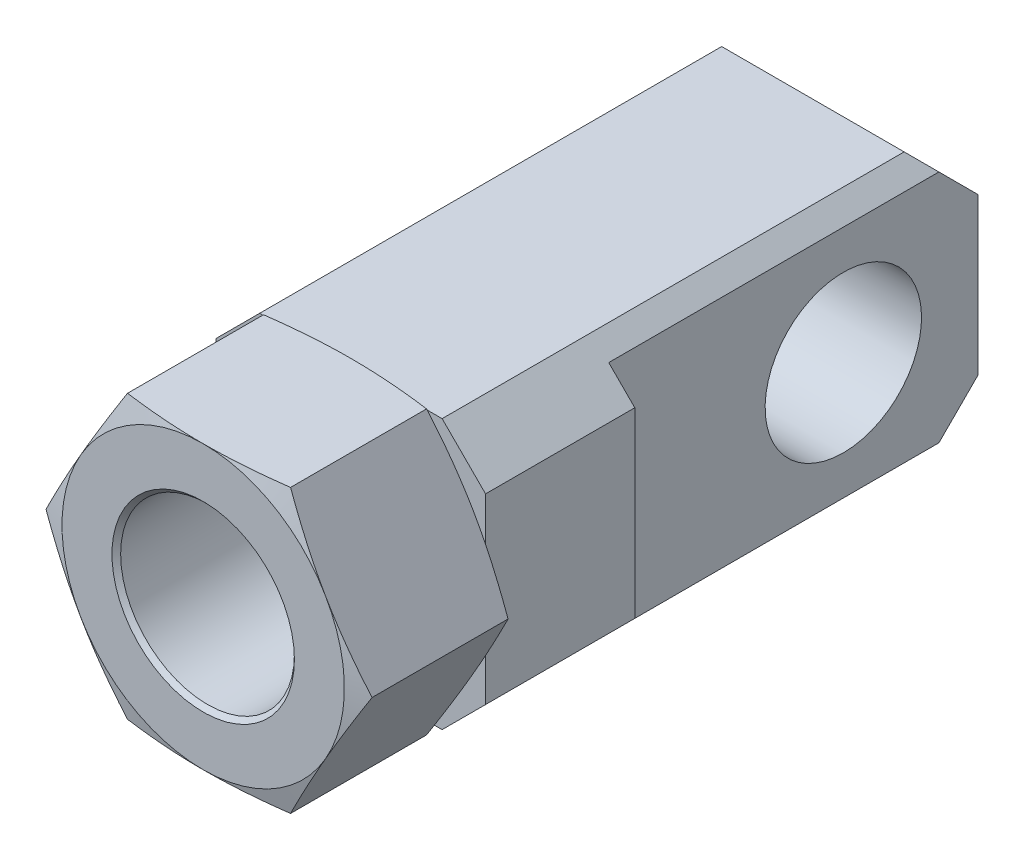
ISO-10303-21;
HEADER;
FILE_DESCRIPTION(('STEP AP214'),'2;1');
FILE_NAME('part.step','',(''),(''),'','','');
FILE_SCHEMA(('AUTOMOTIVE_DESIGN { 1 0 10303 214 1 1 1 1 }'));
ENDSEC;
DATA;
#1=APPLICATION_CONTEXT('core data for automotive mechanical design processes');
#2=APPLICATION_PROTOCOL_DEFINITION('international standard','automotive_design',2000,#1);
#3=PRODUCT_CONTEXT('',#1,'mechanical');
#4=PRODUCT('Part','Part','',(#3));
#5=PRODUCT_RELATED_PRODUCT_CATEGORY('part','',(#4));
#6=PRODUCT_DEFINITION_FORMATION('','',#4);
#7=PRODUCT_DEFINITION_CONTEXT('part definition',#1,'design');
#8=PRODUCT_DEFINITION('design','',#6,#7);
#9=PRODUCT_DEFINITION_SHAPE('','',#8);
#10=(LENGTH_UNIT() NAMED_UNIT(*) SI_UNIT(.MILLI.,.METRE.));
#11=(NAMED_UNIT(*) PLANE_ANGLE_UNIT() SI_UNIT($,.RADIAN.));
#12=(NAMED_UNIT(*) SI_UNIT($,.STERADIAN.) SOLID_ANGLE_UNIT());
#13=UNCERTAINTY_MEASURE_WITH_UNIT(LENGTH_MEASURE(1.E-05),#10,'distance_accuracy_value','');
#14=(GEOMETRIC_REPRESENTATION_CONTEXT(3) GLOBAL_UNCERTAINTY_ASSIGNED_CONTEXT((#13)) GLOBAL_UNIT_ASSIGNED_CONTEXT((#10,
#11,#12)) REPRESENTATION_CONTEXT('',''));
#15=CARTESIAN_POINT('',(0.,0.,0.));
#16=DIRECTION('',(0.,0.,1.));
#17=DIRECTION('',(1.,0.,0.));
#18=AXIS2_PLACEMENT_3D('',#15,#16,#17);
#19=CARTESIAN_POINT('',(0.,0.,-81.244));
#20=DIRECTION('',(0.,0.,1.));
#21=DIRECTION('',(1.,0.,0.));
#22=AXIS2_PLACEMENT_3D('',#19,#20,#21);
#23=CONICAL_SURFACE('',#22,18.75,1.02974425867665);
#24=CARTESIAN_POINT('',(0.,0.,-92.5101366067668));
#25=VERTEX_POINT('',#24);
#26=VERTEX_LOOP('',#25);
#27=FACE_BOUND('',#26,.T.);
#28=CARTESIAN_POINT('',(0.,0.,-81.244));
#29=DIRECTION('',(0.,0.,1.));
#30=DIRECTION('',(1.,0.,0.));
#31=AXIS2_PLACEMENT_3D('',#28,#29,#30);
#32=CIRCLE('',#31,18.75);
#33=CARTESIAN_POINT('',(18.75,0.,-81.244));
#34=VERTEX_POINT('',#33);
#35=EDGE_CURVE('E470',#34,#34,#32,.T.);
#36=ORIENTED_EDGE('',*,*,#35,.T.);
#37=EDGE_LOOP('',(#36));
#38=FACE_BOUND('',#37,.T.);
#39=ADVANCED_FACE('F14',(#27,#38),#23,.F.);
#40=CARTESIAN_POINT('',(0.,0.,-34.));
#41=DIRECTION('',(0.,0.,1.));
#42=DIRECTION('',(1.,0.,0.));
#43=AXIS2_PLACEMENT_3D('',#40,#41,#42);
#44=CYLINDRICAL_SURFACE('',#43,18.75);
#45=ORIENTED_EDGE('',*,*,#35,.F.);
#46=EDGE_LOOP('',(#45));
#47=FACE_BOUND('',#46,.T.);
#48=CARTESIAN_POINT('',(0.,0.,-36.275));
#49=DIRECTION('',(0.,0.,1.));
#50=DIRECTION('',(1.,0.,0.));
#51=AXIS2_PLACEMENT_3D('',#48,#49,#50);
#52=CIRCLE('',#51,18.75);
#53=CARTESIAN_POINT('',(18.75,0.,-36.275));
#54=VERTEX_POINT('',#53);
#55=EDGE_CURVE('E467',#54,#54,#52,.T.);
#56=ORIENTED_EDGE('',*,*,#55,.T.);
#57=EDGE_LOOP('',(#56));
#58=FACE_BOUND('',#57,.T.);
#59=ADVANCED_FACE('F648',(#47,#58),#44,.F.);
#60=CARTESIAN_POINT('',(0.,0.,-34.));
#61=DIRECTION('',(0.,0.,1.));
#62=DIRECTION('',(1.,0.,0.));
#63=AXIS2_PLACEMENT_3D('',#60,#61,#62);
#64=CONICAL_SURFACE('',#63,21.025,0.785398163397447);
#65=ORIENTED_EDGE('',*,*,#55,.F.);
#66=EDGE_LOOP('',(#65));
#67=FACE_BOUND('',#66,.T.);
#68=CARTESIAN_POINT('',(0.,0.,-34.));
#69=DIRECTION('',(0.,0.,1.));
#70=DIRECTION('',(1.,0.,0.));
#71=AXIS2_PLACEMENT_3D('',#68,#69,#70);
#72=CIRCLE('',#71,21.025);
#73=CARTESIAN_POINT('',(21.025,0.,-34.));
#74=VERTEX_POINT('',#73);
#75=EDGE_CURVE('E464',#74,#74,#72,.T.);
#76=ORIENTED_EDGE('',*,*,#75,.T.);
#77=EDGE_LOOP('',(#76));
#78=FACE_BOUND('',#77,.T.);
#79=ADVANCED_FACE('F654',(#67,#78),#64,.F.);
#80=CARTESIAN_POINT('',(0.,0.,-34.));
#81=DIRECTION('',(0.,0.,-1.));
#82=DIRECTION('',(-1.,0.,0.));
#83=AXIS2_PLACEMENT_3D('',#80,#81,#82);
#84=PLANE('',#83);
#85=CARTESIAN_POINT('',(0.,0.,-34.));
#86=DIRECTION('',(0.,0.,-1.));
#87=DIRECTION('',(-1.,0.,0.));
#88=AXIS2_PLACEMENT_3D('',#85,#86,#87);
#89=CIRCLE('',#88,32.5);
#90=CARTESIAN_POINT('',(28.1458256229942,-16.25,-34.));
#91=VERTEX_POINT('',#90);
#92=CARTESIAN_POINT('',(31.,-9.75961064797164,-34.));
#93=VERTEX_POINT('',#92);
#94=EDGE_CURVE('E9',#91,#93,#89,.F.);
#95=ORIENTED_EDGE('',*,*,#94,.F.);
#96=CARTESIAN_POINT('',(0.,0.,-34.));
#97=DIRECTION('',(0.,0.,-1.));
#98=DIRECTION('',(-1.,0.,0.));
#99=AXIS2_PLACEMENT_3D('',#96,#97,#98);
#100=CIRCLE('',#99,32.5);
#101=CARTESIAN_POINT('',(9.75961064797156,-31.,-34.));
#102=VERTEX_POINT('',#101);
#103=EDGE_CURVE('E30',#102,#91,#100,.F.);
#104=ORIENTED_EDGE('',*,*,#103,.F.);
#105=DIRECTION('',(-1.,0.,0.));
#106=VECTOR('',#105,1.);
#107=CARTESIAN_POINT('',(0.,-31.,-34.));
#108=LINE('',#107,#106);
#109=CARTESIAN_POINT('',(21.,-31.,-34.));
#110=VERTEX_POINT('',#109);
#111=EDGE_CURVE('E509',#110,#102,#108,.T.);
#112=ORIENTED_EDGE('',*,*,#111,.F.);
#113=DIRECTION('',(0.707106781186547,0.707106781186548,0.));
#114=VECTOR('',#113,1.);
#115=CARTESIAN_POINT('',(26.,-26.,-34.));
#116=LINE('',#115,#114);
#117=CARTESIAN_POINT('',(31.,-21.,-34.));
#118=VERTEX_POINT('',#117);
#119=EDGE_CURVE('E566',#110,#118,#116,.T.);
#120=ORIENTED_EDGE('',*,*,#119,.T.);
#121=DIRECTION('',(0.,-1.,0.));
#122=VECTOR('',#121,1.);
#123=CARTESIAN_POINT('',(31.,0.,-34.));
#124=LINE('',#123,#122);
#125=EDGE_CURVE('E520',#93,#118,#124,.T.);
#126=ORIENTED_EDGE('',*,*,#125,.F.);
#127=EDGE_LOOP('',(#95,#104,#112,#120,#126));
#128=FACE_BOUND('',#127,.T.);
#129=ADVANCED_FACE('F563',(#128),#84,.F.);
#130=CARTESIAN_POINT('',(0.,0.,-34.));
#131=DIRECTION('',(0.,0.,-1.));
#132=DIRECTION('',(-1.,0.,0.));
#133=AXIS2_PLACEMENT_3D('',#130,#131,#132);
#134=CIRCLE('',#133,32.5);
#135=CARTESIAN_POINT('',(-28.1458256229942,-16.25,-34.));
#136=VERTEX_POINT('',#135);
#137=CARTESIAN_POINT('',(-9.75961064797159,-31.,-34.));
#138=VERTEX_POINT('',#137);
#139=EDGE_CURVE('E547',#136,#138,#134,.F.);
#140=ORIENTED_EDGE('',*,*,#139,.F.);
#141=CARTESIAN_POINT('',(0.,0.,-34.));
#142=DIRECTION('',(0.,0.,-1.));
#143=DIRECTION('',(-1.,0.,0.));
#144=AXIS2_PLACEMENT_3D('',#141,#142,#143);
#145=CIRCLE('',#144,32.5);
#146=CARTESIAN_POINT('',(-31.,-9.75961064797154,-34.));
#147=VERTEX_POINT('',#146);
#148=EDGE_CURVE('E240',#147,#136,#145,.F.);
#149=ORIENTED_EDGE('',*,*,#148,.F.);
#150=DIRECTION('',(0.,1.,0.));
#151=VECTOR('',#150,1.);
#152=CARTESIAN_POINT('',(-31.,0.,-34.));
#153=LINE('',#152,#151);
#154=CARTESIAN_POINT('',(-31.,-21.,-34.));
#155=VERTEX_POINT('',#154);
#156=EDGE_CURVE('E513',#155,#147,#153,.T.);
#157=ORIENTED_EDGE('',*,*,#156,.F.);
#158=DIRECTION('',(-0.707106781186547,0.707106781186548,0.));
#159=VECTOR('',#158,1.);
#160=CARTESIAN_POINT('',(-26.,-26.,-34.));
#161=LINE('',#160,#159);
#162=CARTESIAN_POINT('',(-21.,-31.,-34.));
#163=VERTEX_POINT('',#162);
#164=EDGE_CURVE('E450',#163,#155,#161,.T.);
#165=ORIENTED_EDGE('',*,*,#164,.F.);
#166=EDGE_CURVE('E500',#138,#163,#108,.T.);
#167=ORIENTED_EDGE('',*,*,#166,.F.);
#168=EDGE_LOOP('',(#140,#149,#157,#165,#167));
#169=FACE_BOUND('',#168,.T.);
#170=ADVANCED_FACE('F592',(#169),#84,.F.);
#171=CARTESIAN_POINT('',(-28.1458256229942,16.25,-34.));
#172=VERTEX_POINT('',#171);
#173=CARTESIAN_POINT('',(-31.,9.75961064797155,-34.));
#174=VERTEX_POINT('',#173);
#175=EDGE_CURVE('E229',#172,#174,#145,.F.);
#176=ORIENTED_EDGE('',*,*,#175,.F.);
#177=CARTESIAN_POINT('',(0.,0.,-34.));
#178=DIRECTION('',(0.,0.,-1.));
#179=DIRECTION('',(-1.,0.,0.));
#180=AXIS2_PLACEMENT_3D('',#177,#178,#179);
#181=CIRCLE('',#180,32.5);
#182=CARTESIAN_POINT('',(-9.75961064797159,31.,-34.));
#183=VERTEX_POINT('',#182);
#184=EDGE_CURVE('E233',#183,#172,#181,.F.);
#185=ORIENTED_EDGE('',*,*,#184,.F.);
#186=DIRECTION('',(1.,0.,0.));
#187=VECTOR('',#186,1.);
#188=CARTESIAN_POINT('',(0.,31.,-34.));
#189=LINE('',#188,#187);
#190=CARTESIAN_POINT('',(-21.,31.,-34.));
#191=VERTEX_POINT('',#190);
#192=EDGE_CURVE('E518',#191,#183,#189,.T.);
#193=ORIENTED_EDGE('',*,*,#192,.F.);
#194=DIRECTION('',(-0.707106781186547,-0.707106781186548,0.));
#195=VECTOR('',#194,1.);
#196=CARTESIAN_POINT('',(-26.,26.,-34.));
#197=LINE('',#196,#195);
#198=CARTESIAN_POINT('',(-31.,21.,-34.));
#199=VERTEX_POINT('',#198);
#200=EDGE_CURVE('E418',#191,#199,#197,.T.);
#201=ORIENTED_EDGE('',*,*,#200,.T.);
#202=EDGE_CURVE('E120',#174,#199,#153,.T.);
#203=ORIENTED_EDGE('',*,*,#202,.F.);
#204=EDGE_LOOP('',(#176,#185,#193,#201,#203));
#205=FACE_BOUND('',#204,.T.);
#206=ADVANCED_FACE('F231',(#205),#84,.F.);
#207=CARTESIAN_POINT('',(31.,-31.,-22.947200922));
#208=DIRECTION('',(0.,-1.,0.));
#209=DIRECTION('',(0.,0.,-1.));
#210=AXIS2_PLACEMENT_3D('',#207,#208,#209);
#211=PLANE('',#210);
#212=DIRECTION('',(-1.,0.,0.));
#213=VECTOR('',#212,1.);
#214=CARTESIAN_POINT('',(31.,-31.,-140.3472008));
#215=LINE('',#214,#213);
#216=CARTESIAN_POINT('',(21.,-31.,-140.3472008));
#217=VERTEX_POINT('',#216);
#218=CARTESIAN_POINT('',(-21.,-31.,-140.3472008));
#219=VERTEX_POINT('',#218);
#220=EDGE_CURVE('E476',#217,#219,#215,.T.);
#221=ORIENTED_EDGE('',*,*,#220,.F.);
#222=DIRECTION('',(0.,0.,1.));
#223=VECTOR('',#222,1.);
#224=CARTESIAN_POINT('',(21.,-31.,-153.3472008));
#225=LINE('',#224,#223);
#226=EDGE_CURVE('E432',#217,#110,#225,.T.);
#227=ORIENTED_EDGE('',*,*,#226,.T.);
#228=ORIENTED_EDGE('',*,*,#111,.T.);
#229=EDGE_CURVE('E512',#102,#138,#108,.T.);
#230=ORIENTED_EDGE('',*,*,#229,.T.);
#231=ORIENTED_EDGE('',*,*,#166,.T.);
#232=DIRECTION('',(0.,0.,1.));
#233=VECTOR('',#232,1.);
#234=CARTESIAN_POINT('',(-21.,-31.,-153.3472008));
#235=LINE('',#234,#233);
#236=EDGE_CURVE('E452',#219,#163,#235,.T.);
#237=ORIENTED_EDGE('',*,*,#236,.F.);
#238=EDGE_LOOP('',(#221,#227,#228,#230,#231,#237));
#239=FACE_BOUND('',#238,.T.);
#240=ADVANCED_FACE('F689',(#239),#211,.T.);
#241=CARTESIAN_POINT('',(31.,31.,-22.947200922));
#242=DIRECTION('',(0.,1.,0.));
#243=DIRECTION('',(0.,0.,1.));
#244=AXIS2_PLACEMENT_3D('',#241,#242,#243);
#245=PLANE('',#244);
#246=DIRECTION('',(0.,0.,1.));
#247=VECTOR('',#246,1.);
#248=CARTESIAN_POINT('',(21.,31.,-153.3472008));
#249=LINE('',#248,#247);
#250=CARTESIAN_POINT('',(21.,31.,-140.3472008));
#251=VERTEX_POINT('',#250);
#252=CARTESIAN_POINT('',(21.,31.,-34.));
#253=VERTEX_POINT('',#252);
#254=EDGE_CURVE('E425',#251,#253,#249,.T.);
#255=ORIENTED_EDGE('',*,*,#254,.F.);
#256=DIRECTION('',(-1.,0.,0.));
#257=VECTOR('',#256,1.);
#258=CARTESIAN_POINT('',(31.,31.,-140.3472008));
#259=LINE('',#258,#257);
#260=CARTESIAN_POINT('',(-21.,31.,-140.3472008));
#261=VERTEX_POINT('',#260);
#262=EDGE_CURVE('E477',#251,#261,#259,.T.);
#263=ORIENTED_EDGE('',*,*,#262,.T.);
#264=DIRECTION('',(0.,0.,1.));
#265=VECTOR('',#264,1.);
#266=CARTESIAN_POINT('',(-21.,31.,-153.3472008));
#267=LINE('',#266,#265);
#268=EDGE_CURVE('E419',#261,#191,#267,.T.);
#269=ORIENTED_EDGE('',*,*,#268,.T.);
#270=ORIENTED_EDGE('',*,*,#192,.T.);
#271=CARTESIAN_POINT('',(9.75961064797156,31.,-34.));
#272=VERTEX_POINT('',#271);
#273=EDGE_CURVE('E521',#183,#272,#189,.T.);
#274=ORIENTED_EDGE('',*,*,#273,.T.);
#275=EDGE_CURVE('E516',#272,#253,#189,.T.);
#276=ORIENTED_EDGE('',*,*,#275,.T.);
#277=EDGE_LOOP('',(#255,#263,#269,#270,#274,#276));
#278=FACE_BOUND('',#277,.T.);
#279=ADVANCED_FACE('F685',(#278),#245,.T.);
#280=CARTESIAN_POINT('',(25.,31.,-153.3472008));
#281=DIRECTION('',(-1.,0.,0.));
#282=DIRECTION('',(0.,-1.,0.));
#283=AXIS2_PLACEMENT_3D('',#280,#281,#282);
#284=PLANE('',#283);
#285=CARTESIAN_POINT('',(25.,0.,-122.3472008));
#286=DIRECTION('',(-1.,0.,0.));
#287=DIRECTION('',(0.,-1.,0.));
#288=AXIS2_PLACEMENT_3D('',#285,#286,#287);
#289=CIRCLE('',#288,18.);
#290=CARTESIAN_POINT('',(25.,-18.,-122.3472008));
#291=VERTEX_POINT('',#290);
#292=EDGE_CURVE('E491',#291,#291,#289,.T.);
#293=ORIENTED_EDGE('',*,*,#292,.T.);
#294=EDGE_LOOP('',(#293));
#295=FACE_BOUND('',#294,.T.);
#296=DIRECTION('',(0.,0.,1.));
#297=VECTOR('',#296,1.);
#298=CARTESIAN_POINT('',(25.,-27.,-153.3472008));
#299=LINE('',#298,#297);
#300=CARTESIAN_POINT('',(25.,-27.,-144.3472008));
#301=VERTEX_POINT('',#300);
#302=CARTESIAN_POINT('',(25.,-27.,-68.3472008));
#303=VERTEX_POINT('',#302);
#304=EDGE_CURVE('E440',#301,#303,#299,.T.);
#305=ORIENTED_EDGE('',*,*,#304,.F.);
#306=DIRECTION('',(0.,0.707106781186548,-0.707106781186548));
#307=VECTOR('',#306,1.);
#308=CARTESIAN_POINT('',(25.,6.5,-177.8472008));
#309=LINE('',#308,#307);
#310=CARTESIAN_POINT('',(25.,-18.,-153.3472008));
#311=VERTEX_POINT('',#310);
#312=EDGE_CURVE('E486',#301,#311,#309,.T.);
#313=ORIENTED_EDGE('',*,*,#312,.T.);
#314=DIRECTION('',(0.,-1.,0.));
#315=VECTOR('',#314,1.);
#316=CARTESIAN_POINT('',(25.,31.,-153.3472008));
#317=LINE('',#316,#315);
#318=CARTESIAN_POINT('',(25.,18.,-153.3472008));
#319=VERTEX_POINT('',#318);
#320=EDGE_CURVE('E494',#319,#311,#317,.T.);
#321=ORIENTED_EDGE('',*,*,#320,.F.);
#322=DIRECTION('',(0.,0.707106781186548,0.707106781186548));
#323=VECTOR('',#322,1.);
#324=CARTESIAN_POINT('',(25.,24.5,-146.8472008));
#325=LINE('',#324,#323);
#326=CARTESIAN_POINT('',(25.,27.,-144.3472008));
#327=VERTEX_POINT('',#326);
#328=EDGE_CURVE('E479',#319,#327,#325,.T.);
#329=ORIENTED_EDGE('',*,*,#328,.T.);
#330=DIRECTION('',(0.,0.,1.));
#331=VECTOR('',#330,1.);
#332=CARTESIAN_POINT('',(25.,27.,-153.3472008));
#333=LINE('',#332,#331);
#334=CARTESIAN_POINT('',(25.,27.,-68.3472008));
#335=VERTEX_POINT('',#334);
#336=EDGE_CURVE('E431',#327,#335,#333,.T.);
#337=ORIENTED_EDGE('',*,*,#336,.T.);
#338=DIRECTION('',(0.,-1.,0.));
#339=VECTOR('',#338,1.);
#340=CARTESIAN_POINT('',(25.,31.,-68.3472008));
#341=LINE('',#340,#339);
#342=EDGE_CURVE('E501',#335,#303,#341,.T.);
#343=ORIENTED_EDGE('',*,*,#342,.T.);
#344=EDGE_LOOP('',(#305,#313,#321,#329,#337,#343));
#345=FACE_BOUND('',#344,.T.);
#346=ADVANCED_FACE('F681',(#295,#345),#284,.F.);
#347=CARTESIAN_POINT('',(-25.,31.,-153.3472008));
#348=DIRECTION('',(1.,0.,0.));
#349=DIRECTION('',(0.,1.,0.));
#350=AXIS2_PLACEMENT_3D('',#347,#348,#349);
#351=PLANE('',#350);
#352=CARTESIAN_POINT('',(-25.,0.,-122.3472008));
#353=DIRECTION('',(-1.,0.,0.));
#354=DIRECTION('',(0.,-1.,0.));
#355=AXIS2_PLACEMENT_3D('',#352,#353,#354);
#356=CIRCLE('',#355,18.);
#357=CARTESIAN_POINT('',(-25.,-18.,-122.3472008));
#358=VERTEX_POINT('',#357);
#359=EDGE_CURVE('E488',#358,#358,#356,.T.);
#360=ORIENTED_EDGE('',*,*,#359,.F.);
#361=EDGE_LOOP('',(#360));
#362=FACE_BOUND('',#361,.T.);
#363=DIRECTION('',(0.,0.,1.));
#364=VECTOR('',#363,1.);
#365=CARTESIAN_POINT('',(-25.,27.,-153.3472008));
#366=LINE('',#365,#364);
#367=CARTESIAN_POINT('',(-25.,27.,-144.3472008));
#368=VERTEX_POINT('',#367);
#369=CARTESIAN_POINT('',(-25.,27.,-68.3472008));
#370=VERTEX_POINT('',#369);
#371=EDGE_CURVE('E446',#368,#370,#366,.T.);
#372=ORIENTED_EDGE('',*,*,#371,.F.);
#373=DIRECTION('',(0.,0.707106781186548,0.707106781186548));
#374=VECTOR('',#373,1.);
#375=CARTESIAN_POINT('',(-25.,31.,-140.3472008));
#376=LINE('',#375,#374);
#377=CARTESIAN_POINT('',(-25.,18.,-153.3472008));
#378=VERTEX_POINT('',#377);
#379=EDGE_CURVE('E473',#378,#368,#376,.T.);
#380=ORIENTED_EDGE('',*,*,#379,.F.);
#381=DIRECTION('',(0.,1.,0.));
#382=VECTOR('',#381,1.);
#383=CARTESIAN_POINT('',(-25.,31.,-153.3472008));
#384=LINE('',#383,#382);
#385=CARTESIAN_POINT('',(-25.,-18.,-153.3472008));
#386=VERTEX_POINT('',#385);
#387=EDGE_CURVE('E497',#386,#378,#384,.T.);
#388=ORIENTED_EDGE('',*,*,#387,.F.);
#389=DIRECTION('',(0.,0.707106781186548,-0.707106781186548));
#390=VECTOR('',#389,1.);
#391=CARTESIAN_POINT('',(-25.,-31.,-140.3472008));
#392=LINE('',#391,#390);
#393=CARTESIAN_POINT('',(-25.,-27.,-144.3472008));
#394=VERTEX_POINT('',#393);
#395=EDGE_CURVE('E474',#394,#386,#392,.T.);
#396=ORIENTED_EDGE('',*,*,#395,.F.);
#397=DIRECTION('',(0.,0.,1.));
#398=VECTOR('',#397,1.);
#399=CARTESIAN_POINT('',(-25.,-27.,-153.3472008));
#400=LINE('',#399,#398);
#401=CARTESIAN_POINT('',(-25.,-27.,-68.3472008));
#402=VERTEX_POINT('',#401);
#403=EDGE_CURVE('E458',#394,#402,#400,.T.);
#404=ORIENTED_EDGE('',*,*,#403,.T.);
#405=DIRECTION('',(0.,1.,0.));
#406=VECTOR('',#405,1.);
#407=CARTESIAN_POINT('',(-25.,31.,-68.3472008));
#408=LINE('',#407,#406);
#409=EDGE_CURVE('E505',#402,#370,#408,.T.);
#410=ORIENTED_EDGE('',*,*,#409,.T.);
#411=EDGE_LOOP('',(#372,#380,#388,#396,#404,#410));
#412=FACE_BOUND('',#411,.T.);
#413=ADVANCED_FACE('F668',(#362,#412),#351,.F.);
#414=CARTESIAN_POINT('',(31.,31.,-140.3472008));
#415=DIRECTION('',(0.,-0.707106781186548,0.707106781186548));
#416=DIRECTION('',(0.,-0.707106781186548,-0.707106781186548));
#417=AXIS2_PLACEMENT_3D('',#414,#415,#416);
#418=PLANE('',#417);
#419=ORIENTED_EDGE('',*,*,#262,.F.);
#420=DIRECTION('',(0.577350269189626,-0.577350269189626,-0.577350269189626));
#421=VECTOR('',#420,1.);
#422=CARTESIAN_POINT('',(24.3333333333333,27.6666666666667,-143.680534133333));
#423=LINE('',#422,#421);
#424=EDGE_CURVE('E435',#251,#327,#423,.T.);
#425=ORIENTED_EDGE('',*,*,#424,.T.);
#426=ORIENTED_EDGE('',*,*,#328,.F.);
#427=DIRECTION('',(-1.,0.,0.));
#428=VECTOR('',#427,1.);
#429=CARTESIAN_POINT('',(0.,18.,-153.3472008));
#430=LINE('',#429,#428);
#431=EDGE_CURVE('E504',#319,#378,#430,.T.);
#432=ORIENTED_EDGE('',*,*,#431,.T.);
#433=ORIENTED_EDGE('',*,*,#379,.T.);
#434=DIRECTION('',(-0.577350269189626,-0.577350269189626,-0.577350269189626));
#435=VECTOR('',#434,1.);
#436=CARTESIAN_POINT('',(-3.66666666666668,48.3333333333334,-123.013867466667));
#437=LINE('',#436,#435);
#438=EDGE_CURVE('E448',#261,#368,#437,.T.);
#439=ORIENTED_EDGE('',*,*,#438,.F.);
#440=EDGE_LOOP('',(#419,#425,#426,#432,#433,#439));
#441=FACE_BOUND('',#440,.T.);
#442=ADVANCED_FACE('F664',(#441),#418,.F.);
#443=CARTESIAN_POINT('',(31.,-31.,-140.3472008));
#444=DIRECTION('',(0.,0.707106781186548,0.707106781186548));
#445=DIRECTION('',(0.,-0.707106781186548,0.707106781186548));
#446=AXIS2_PLACEMENT_3D('',#443,#444,#445);
#447=PLANE('',#446);
#448=DIRECTION('',(0.577350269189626,0.577350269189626,-0.577350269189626));
#449=VECTOR('',#448,1.);
#450=CARTESIAN_POINT('',(24.3333333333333,-27.6666666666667,-143.680534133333));
#451=LINE('',#450,#449);
#452=EDGE_CURVE('E442',#217,#301,#451,.T.);
#453=ORIENTED_EDGE('',*,*,#452,.F.);
#454=ORIENTED_EDGE('',*,*,#220,.T.);
#455=DIRECTION('',(-0.577350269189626,0.577350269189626,-0.577350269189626));
#456=VECTOR('',#455,1.);
#457=CARTESIAN_POINT('',(-3.66666666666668,-48.3333333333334,-123.013867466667));
#458=LINE('',#457,#456);
#459=EDGE_CURVE('E461',#219,#394,#458,.T.);
#460=ORIENTED_EDGE('',*,*,#459,.T.);
#461=ORIENTED_EDGE('',*,*,#395,.T.);
#462=DIRECTION('',(1.,0.,0.));
#463=VECTOR('',#462,1.);
#464=CARTESIAN_POINT('',(0.,-18.,-153.3472008));
#465=LINE('',#464,#463);
#466=EDGE_CURVE('E531',#386,#311,#465,.T.);
#467=ORIENTED_EDGE('',*,*,#466,.T.);
#468=ORIENTED_EDGE('',*,*,#312,.F.);
#469=EDGE_LOOP('',(#453,#454,#460,#461,#467,#468));
#470=FACE_BOUND('',#469,.T.);
#471=ADVANCED_FACE('F660',(#470),#447,.F.);
#472=CARTESIAN_POINT('',(0.,37.465,-68.3472008));
#473=DIRECTION('',(0.,0.,1.));
#474=DIRECTION('',(1.,0.,0.));
#475=AXIS2_PLACEMENT_3D('',#472,#473,#474);
#476=PLANE('',#475);
#477=DIRECTION('',(0.707106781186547,0.707106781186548,0.));
#478=VECTOR('',#477,1.);
#479=CARTESIAN_POINT('',(44.7325,-7.2675,-68.3472008));
#480=LINE('',#479,#478);
#481=CARTESIAN_POINT('',(31.,-21.,-68.3472008));
#482=VERTEX_POINT('',#481);
#483=EDGE_CURVE('E438',#303,#482,#480,.T.);
#484=ORIENTED_EDGE('',*,*,#483,.F.);
#485=ORIENTED_EDGE('',*,*,#342,.F.);
#486=DIRECTION('',(0.707106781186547,-0.707106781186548,0.));
#487=VECTOR('',#486,1.);
#488=CARTESIAN_POINT('',(7.2675,44.7325,-68.3472008));
#489=LINE('',#488,#487);
#490=CARTESIAN_POINT('',(31.,21.,-68.3472008));
#491=VERTEX_POINT('',#490);
#492=EDGE_CURVE('E428',#335,#491,#489,.T.);
#493=ORIENTED_EDGE('',*,*,#492,.T.);
#494=DIRECTION('',(0.,1.,0.));
#495=VECTOR('',#494,1.);
#496=CARTESIAN_POINT('',(31.,37.465,-68.3472008));
#497=LINE('',#496,#495);
#498=EDGE_CURVE('E508',#482,#491,#497,.T.);
#499=ORIENTED_EDGE('',*,*,#498,.F.);
#500=EDGE_LOOP('',(#484,#485,#493,#499));
#501=FACE_BOUND('',#500,.T.);
#502=ADVANCED_FACE('F663',(#501),#476,.F.);
#503=DIRECTION('',(-0.707106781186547,-0.707106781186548,0.));
#504=VECTOR('',#503,1.);
#505=CARTESIAN_POINT('',(-7.2675,44.7325,-68.3472008));
#506=LINE('',#505,#504);
#507=CARTESIAN_POINT('',(-31.,21.,-68.3472008));
#508=VERTEX_POINT('',#507);
#509=EDGE_CURVE('E444',#370,#508,#506,.T.);
#510=ORIENTED_EDGE('',*,*,#509,.F.);
#511=ORIENTED_EDGE('',*,*,#409,.F.);
#512=DIRECTION('',(-0.707106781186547,0.707106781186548,0.));
#513=VECTOR('',#512,1.);
#514=CARTESIAN_POINT('',(-44.7325,-7.2675,-68.3472008));
#515=LINE('',#514,#513);
#516=CARTESIAN_POINT('',(-31.,-21.,-68.3472008));
#517=VERTEX_POINT('',#516);
#518=EDGE_CURVE('E455',#402,#517,#515,.T.);
#519=ORIENTED_EDGE('',*,*,#518,.T.);
#520=DIRECTION('',(0.,-1.,0.));
#521=VECTOR('',#520,1.);
#522=CARTESIAN_POINT('',(-31.,37.465,-68.3472008));
#523=LINE('',#522,#521);
#524=EDGE_CURVE('E525',#508,#517,#523,.T.);
#525=ORIENTED_EDGE('',*,*,#524,.F.);
#526=EDGE_LOOP('',(#510,#511,#519,#525));
#527=FACE_BOUND('',#526,.T.);
#528=ADVANCED_FACE('F698',(#527),#476,.F.);
#529=CARTESIAN_POINT('',(31.,9.75961064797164,-34.));
#530=VERTEX_POINT('',#529);
#531=CARTESIAN_POINT('',(28.1458256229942,16.25,-34.));
#532=VERTEX_POINT('',#531);
#533=EDGE_CURVE('E32',#530,#532,#89,.F.);
#534=ORIENTED_EDGE('',*,*,#533,.F.);
#535=CARTESIAN_POINT('',(31.,21.,-34.));
#536=VERTEX_POINT('',#535);
#537=EDGE_CURVE('E522',#536,#530,#124,.T.);
#538=ORIENTED_EDGE('',*,*,#537,.F.);
#539=DIRECTION('',(0.707106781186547,-0.707106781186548,0.));
#540=VECTOR('',#539,1.);
#541=CARTESIAN_POINT('',(26.,26.,-34.));
#542=LINE('',#541,#540);
#543=EDGE_CURVE('E422',#253,#536,#542,.T.);
#544=ORIENTED_EDGE('',*,*,#543,.F.);
#545=ORIENTED_EDGE('',*,*,#275,.F.);
#546=CARTESIAN_POINT('',(0.,0.,-34.));
#547=DIRECTION('',(0.,0.,-1.));
#548=DIRECTION('',(-1.,0.,0.));
#549=AXIS2_PLACEMENT_3D('',#546,#547,#548);
#550=CIRCLE('',#549,32.5);
#551=EDGE_CURVE('E544',#532,#272,#550,.F.);
#552=ORIENTED_EDGE('',*,*,#551,.F.);
#553=EDGE_LOOP('',(#534,#538,#544,#545,#552));
#554=FACE_BOUND('',#553,.T.);
#555=ADVANCED_FACE('F298',(#554),#84,.F.);
#556=CARTESIAN_POINT('',(-31.,31.,-22.947200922));
#557=DIRECTION('',(-1.,0.,0.));
#558=DIRECTION('',(0.,-1.,0.));
#559=AXIS2_PLACEMENT_3D('',#556,#557,#558);
#560=PLANE('',#559);
#561=ORIENTED_EDGE('',*,*,#156,.T.);
#562=EDGE_CURVE('E517',#147,#174,#153,.T.);
#563=ORIENTED_EDGE('',*,*,#562,.T.);
#564=ORIENTED_EDGE('',*,*,#202,.T.);
#565=DIRECTION('',(0.,0.,-1.));
#566=VECTOR('',#565,1.);
#567=CARTESIAN_POINT('',(-31.,21.,-22.947200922));
#568=LINE('',#567,#566);
#569=EDGE_CURVE('E542',#199,#508,#568,.T.);
#570=ORIENTED_EDGE('',*,*,#569,.T.);
#571=ORIENTED_EDGE('',*,*,#524,.T.);
#572=DIRECTION('',(0.,0.,-1.));
#573=VECTOR('',#572,1.);
#574=CARTESIAN_POINT('',(-31.,-21.,-22.947200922));
#575=LINE('',#574,#573);
#576=EDGE_CURVE('E534',#155,#517,#575,.T.);
#577=ORIENTED_EDGE('',*,*,#576,.F.);
#578=EDGE_LOOP('',(#561,#563,#564,#570,#571,#577));
#579=FACE_BOUND('',#578,.T.);
#580=ADVANCED_FACE('F589',(#579),#560,.T.);
#581=CARTESIAN_POINT('',(31.,31.,-22.947200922));
#582=DIRECTION('',(1.,0.,0.));
#583=DIRECTION('',(0.,1.,0.));
#584=AXIS2_PLACEMENT_3D('',#581,#582,#583);
#585=PLANE('',#584);
#586=ORIENTED_EDGE('',*,*,#537,.T.);
#587=EDGE_CURVE('E526',#530,#93,#124,.T.);
#588=ORIENTED_EDGE('',*,*,#587,.T.);
#589=ORIENTED_EDGE('',*,*,#125,.T.);
#590=DIRECTION('',(0.,0.,-1.));
#591=VECTOR('',#590,1.);
#592=CARTESIAN_POINT('',(31.,-21.,-22.947200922));
#593=LINE('',#592,#591);
#594=EDGE_CURVE('E539',#118,#482,#593,.T.);
#595=ORIENTED_EDGE('',*,*,#594,.T.);
#596=ORIENTED_EDGE('',*,*,#498,.T.);
#597=DIRECTION('',(0.,0.,-1.));
#598=VECTOR('',#597,1.);
#599=CARTESIAN_POINT('',(31.,21.,-22.947200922));
#600=LINE('',#599,#598);
#601=EDGE_CURVE('E537',#536,#491,#600,.T.);
#602=ORIENTED_EDGE('',*,*,#601,.F.);
#603=EDGE_LOOP('',(#586,#588,#589,#595,#596,#602));
#604=FACE_BOUND('',#603,.T.);
#605=ADVANCED_FACE('F569',(#604),#585,.T.);
#606=CARTESIAN_POINT('',(0.,0.,-153.3472008));
#607=DIRECTION('',(0.,0.,-1.));
#608=DIRECTION('',(-1.,0.,0.));
#609=AXIS2_PLACEMENT_3D('',#606,#607,#608);
#610=PLANE('',#609);
#611=ORIENTED_EDGE('',*,*,#466,.F.);
#612=ORIENTED_EDGE('',*,*,#387,.T.);
#613=ORIENTED_EDGE('',*,*,#431,.F.);
#614=ORIENTED_EDGE('',*,*,#320,.T.);
#615=EDGE_LOOP('',(#611,#612,#613,#614));
#616=FACE_BOUND('',#615,.T.);
#617=ADVANCED_FACE('F674',(#616),#610,.T.);
#618=CARTESIAN_POINT('',(31.,0.,-122.3472008));
#619=DIRECTION('',(-1.,0.,0.));
#620=DIRECTION('',(0.,-1.,0.));
#621=AXIS2_PLACEMENT_3D('',#618,#619,#620);
#622=CYLINDRICAL_SURFACE('',#621,18.);
#623=ORIENTED_EDGE('',*,*,#359,.T.);
#624=EDGE_LOOP('',(#623));
#625=FACE_BOUND('',#624,.T.);
#626=ORIENTED_EDGE('',*,*,#292,.F.);
#627=EDGE_LOOP('',(#626));
#628=FACE_BOUND('',#627,.T.);
#629=ADVANCED_FACE('F670',(#625,#628),#622,.F.);
#630=CARTESIAN_POINT('',(-26.,-26.,-153.3472008));
#631=DIRECTION('',(0.707106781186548,0.707106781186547,0.));
#632=DIRECTION('',(-0.707106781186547,0.707106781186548,0.));
#633=AXIS2_PLACEMENT_3D('',#630,#631,#632);
#634=PLANE('',#633);
#635=ORIENTED_EDGE('',*,*,#236,.T.);
#636=ORIENTED_EDGE('',*,*,#164,.T.);
#637=ORIENTED_EDGE('',*,*,#576,.T.);
#638=ORIENTED_EDGE('',*,*,#518,.F.);
#639=ORIENTED_EDGE('',*,*,#403,.F.);
#640=ORIENTED_EDGE('',*,*,#459,.F.);
#641=EDGE_LOOP('',(#635,#636,#637,#638,#639,#640));
#642=FACE_BOUND('',#641,.T.);
#643=ADVANCED_FACE('F673',(#642),#634,.F.);
#644=CARTESIAN_POINT('',(26.,26.,-153.3472008));
#645=DIRECTION('',(-0.707106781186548,-0.707106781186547,0.));
#646=DIRECTION('',(0.707106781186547,-0.707106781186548,0.));
#647=AXIS2_PLACEMENT_3D('',#644,#645,#646);
#648=PLANE('',#647);
#649=ORIENTED_EDGE('',*,*,#254,.T.);
#650=ORIENTED_EDGE('',*,*,#543,.T.);
#651=ORIENTED_EDGE('',*,*,#601,.T.);
#652=ORIENTED_EDGE('',*,*,#492,.F.);
#653=ORIENTED_EDGE('',*,*,#336,.F.);
#654=ORIENTED_EDGE('',*,*,#424,.F.);
#655=EDGE_LOOP('',(#649,#650,#651,#652,#653,#654));
#656=FACE_BOUND('',#655,.T.);
#657=ADVANCED_FACE('F714',(#656),#648,.F.);
#658=CARTESIAN_POINT('',(26.,-26.,-153.3472008));
#659=DIRECTION('',(0.707106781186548,-0.707106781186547,0.));
#660=DIRECTION('',(0.707106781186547,0.707106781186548,0.));
#661=AXIS2_PLACEMENT_3D('',#658,#659,#660);
#662=PLANE('',#661);
#663=ORIENTED_EDGE('',*,*,#452,.T.);
#664=ORIENTED_EDGE('',*,*,#304,.T.);
#665=ORIENTED_EDGE('',*,*,#483,.T.);
#666=ORIENTED_EDGE('',*,*,#594,.F.);
#667=ORIENTED_EDGE('',*,*,#119,.F.);
#668=ORIENTED_EDGE('',*,*,#226,.F.);
#669=EDGE_LOOP('',(#663,#664,#665,#666,#667,#668));
#670=FACE_BOUND('',#669,.T.);
#671=ADVANCED_FACE('F726',(#670),#662,.T.);
#672=CARTESIAN_POINT('',(-26.,26.,-153.3472008));
#673=DIRECTION('',(-0.707106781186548,0.707106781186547,0.));
#674=DIRECTION('',(-0.707106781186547,-0.707106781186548,0.));
#675=AXIS2_PLACEMENT_3D('',#672,#673,#674);
#676=PLANE('',#675);
#677=ORIENTED_EDGE('',*,*,#438,.T.);
#678=ORIENTED_EDGE('',*,*,#371,.T.);
#679=ORIENTED_EDGE('',*,*,#509,.T.);
#680=ORIENTED_EDGE('',*,*,#569,.F.);
#681=ORIENTED_EDGE('',*,*,#200,.F.);
#682=ORIENTED_EDGE('',*,*,#268,.F.);
#683=EDGE_LOOP('',(#677,#678,#679,#680,#681,#682));
#684=FACE_BOUND('',#683,.T.);
#685=ADVANCED_FACE('F737',(#684),#676,.T.);
#686=CARTESIAN_POINT('',(0.,0.,-1.));
#687=DIRECTION('',(0.,0.,1.));
#688=DIRECTION('',(1.,0.,0.));
#689=AXIS2_PLACEMENT_3D('',#686,#687,#688);
#690=CONICAL_SURFACE('',#689,20.,0.785398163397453);
#691=CARTESIAN_POINT('',(0.,0.,0.));
#692=DIRECTION('',(0.,0.,1.));
#693=DIRECTION('',(1.,0.,0.));
#694=AXIS2_PLACEMENT_3D('',#691,#692,#693);
#695=CIRCLE('',#694,21.);
#696=CARTESIAN_POINT('',(21.,0.,0.));
#697=VERTEX_POINT('',#696);
#698=EDGE_CURVE('E399',#697,#697,#695,.F.);
#699=ORIENTED_EDGE('',*,*,#698,.F.);
#700=EDGE_LOOP('',(#699));
#701=FACE_BOUND('',#700,.T.);
#702=CARTESIAN_POINT('',(0.,0.,-1.));
#703=DIRECTION('',(0.,0.,1.));
#704=DIRECTION('',(1.,0.,0.));
#705=AXIS2_PLACEMENT_3D('',#702,#703,#704);
#706=CIRCLE('',#705,20.);
#707=CARTESIAN_POINT('',(20.,0.,-1.));
#708=VERTEX_POINT('',#707);
#709=EDGE_CURVE('E393',#708,#708,#706,.T.);
#710=ORIENTED_EDGE('',*,*,#709,.F.);
#711=EDGE_LOOP('',(#710));
#712=FACE_BOUND('',#711,.T.);
#713=ADVANCED_FACE('F16',(#701,#712),#690,.F.);
#714=CARTESIAN_POINT('',(0.,0.,0.));
#715=DIRECTION('',(0.,0.,-1.));
#716=DIRECTION('',(-1.,0.,0.));
#717=AXIS2_PLACEMENT_3D('',#714,#715,#716);
#718=CYLINDRICAL_SURFACE('',#717,20.);
#719=CARTESIAN_POINT('',(0.,0.,-33.));
#720=DIRECTION('',(0.,0.,1.));
#721=DIRECTION('',(1.,0.,0.));
#722=AXIS2_PLACEMENT_3D('',#719,#720,#721);
#723=CIRCLE('',#722,20.);
#724=CARTESIAN_POINT('',(20.,0.,-33.));
#725=VERTEX_POINT('',#724);
#726=EDGE_CURVE('E396',#725,#725,#723,.F.);
#727=ORIENTED_EDGE('',*,*,#726,.T.);
#728=EDGE_LOOP('',(#727));
#729=FACE_BOUND('',#728,.T.);
#730=ORIENTED_EDGE('',*,*,#709,.T.);
#731=EDGE_LOOP('',(#730));
#732=FACE_BOUND('',#731,.T.);
#733=ADVANCED_FACE('F639',(#729,#732),#718,.F.);
#734=CARTESIAN_POINT('',(0.,0.,-34.));
#735=DIRECTION('',(0.,0.,-1.));
#736=DIRECTION('',(-1.,0.,0.));
#737=AXIS2_PLACEMENT_3D('',#734,#735,#736);
#738=CONICAL_SURFACE('',#737,21.,0.78539816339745);
#739=ORIENTED_EDGE('',*,*,#726,.F.);
#740=EDGE_LOOP('',(#739));
#741=FACE_BOUND('',#740,.T.);
#742=CARTESIAN_POINT('',(0.,0.,-34.));
#743=DIRECTION('',(0.,0.,1.));
#744=DIRECTION('',(1.,0.,0.));
#745=AXIS2_PLACEMENT_3D('',#742,#743,#744);
#746=CIRCLE('',#745,21.);
#747=CARTESIAN_POINT('',(21.,0.,-34.));
#748=VERTEX_POINT('',#747);
#749=EDGE_CURVE('E385',#748,#748,#746,.T.);
#750=ORIENTED_EDGE('',*,*,#749,.F.);
#751=EDGE_LOOP('',(#750));
#752=FACE_BOUND('',#751,.T.);
#753=ADVANCED_FACE('F363',(#741,#752),#738,.F.);
#754=CARTESIAN_POINT('',(0.,0.,-34.));
#755=DIRECTION('',(0.,0.,1.));
#756=DIRECTION('',(1.,0.,0.));
#757=AXIS2_PLACEMENT_3D('',#754,#755,#756);
#758=PLANE('',#757);
#759=ORIENTED_EDGE('',*,*,#749,.T.);
#760=EDGE_LOOP('',(#759));
#761=FACE_BOUND('',#760,.T.);
#762=ORIENTED_EDGE('',*,*,#75,.F.);
#763=EDGE_LOOP('',(#762));
#764=FACE_BOUND('',#763,.T.);
#765=ADVANCED_FACE('F747',(#761,#764),#758,.F.);
#766=CARTESIAN_POINT('',(0.,0.,0.));
#767=DIRECTION('',(0.,0.,1.));
#768=DIRECTION('',(1.,0.,0.));
#769=AXIS2_PLACEMENT_3D('',#766,#767,#768);
#770=PLANE('',#769);
#771=ORIENTED_EDGE('',*,*,#698,.T.);
#772=EDGE_LOOP('',(#771));
#773=FACE_BOUND('',#772,.T.);
#774=CARTESIAN_POINT('',(0.,0.,0.));
#775=DIRECTION('',(0.,0.,-1.));
#776=DIRECTION('',(-1.,0.,0.));
#777=AXIS2_PLACEMENT_3D('',#774,#775,#776);
#778=CIRCLE('',#777,32.5);
#779=CARTESIAN_POINT('',(28.1458256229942,-16.25,0.));
#780=VERTEX_POINT('',#779);
#781=CARTESIAN_POINT('',(0.,-32.5,0.));
#782=VERTEX_POINT('',#781);
#783=EDGE_CURVE('E632',#780,#782,#778,.T.);
#784=ORIENTED_EDGE('',*,*,#783,.F.);
#785=CARTESIAN_POINT('',(28.1458256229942,16.25,0.));
#786=VERTEX_POINT('',#785);
#787=EDGE_CURVE('E630',#786,#780,#778,.T.);
#788=ORIENTED_EDGE('',*,*,#787,.F.);
#789=CARTESIAN_POINT('',(0.,32.5,0.));
#790=VERTEX_POINT('',#789);
#791=EDGE_CURVE('E629',#790,#786,#778,.T.);
#792=ORIENTED_EDGE('',*,*,#791,.F.);
#793=CARTESIAN_POINT('',(-28.1458256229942,16.25,0.));
#794=VERTEX_POINT('',#793);
#795=EDGE_CURVE('E103',#794,#790,#778,.T.);
#796=ORIENTED_EDGE('',*,*,#795,.F.);
#797=CARTESIAN_POINT('',(-28.1458256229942,-16.25,0.));
#798=VERTEX_POINT('',#797);
#799=EDGE_CURVE('E375',#798,#794,#778,.T.);
#800=ORIENTED_EDGE('',*,*,#799,.F.);
#801=EDGE_CURVE('E631',#782,#798,#778,.T.);
#802=ORIENTED_EDGE('',*,*,#801,.F.);
#803=EDGE_LOOP('',(#784,#788,#792,#796,#800,#802));
#804=FACE_BOUND('',#803,.T.);
#805=ADVANCED_FACE('F361',(#773,#804),#770,.T.);
#806=CARTESIAN_POINT('',(0.,0.,0.));
#807=DIRECTION('',(0.,0.,-1.));
#808=DIRECTION('',(-1.,0.,0.));
#809=AXIS2_PLACEMENT_3D('',#806,#807,#808);
#810=CONICAL_SURFACE('',#809,32.5,1.30899693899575);
#811=ORIENTED_EDGE('',*,*,#791,.T.);
#812=CARTESIAN_POINT('',(18.763768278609,32.5002,-1.34721718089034));
#813=CARTESIAN_POINT('',(19.15341069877,31.8253195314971,-1.24281906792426));
#814=CARTESIAN_POINT('',(19.5433691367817,31.1498917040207,-1.14320151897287));
#815=CARTESIAN_POINT('',(20.3239424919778,29.7978989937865,-0.954522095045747));
#816=CARTESIAN_POINT('',(20.7145574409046,29.1213340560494,-0.865460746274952));
#817=CARTESIAN_POINT('',(21.8876450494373,27.0894867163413,-0.615558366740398));
#818=CARTESIAN_POINT('',(22.6710817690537,25.7325345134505,-0.472075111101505));
#819=CARTESIAN_POINT('',(23.8456922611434,23.6980494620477,-0.297500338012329));
#820=CARTESIAN_POINT('',(24.2361338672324,23.0217847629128,-0.246164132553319));
#821=CARTESIAN_POINT('',(25.0174132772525,21.6685691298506,-0.157551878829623));
#822=CARTESIAN_POINT('',(25.4082510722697,20.9916182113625,-0.120275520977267));
#823=CARTESIAN_POINT('',(26.1901389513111,19.6373486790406,-0.0603885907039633));
#824=CARTESIAN_POINT('',(26.5811889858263,18.9600301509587,-0.0377754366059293));
#825=CARTESIAN_POINT('',(27.3634345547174,17.6051410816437,-0.00758115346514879));
#826=CARTESIAN_POINT('',(27.7546300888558,16.9275705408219,0.));
#827=CARTESIAN_POINT('',(28.5370211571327,15.5724294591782,0.));
#828=CARTESIAN_POINT('',(28.9282166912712,14.8948589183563,-0.00758115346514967));
#829=CARTESIAN_POINT('',(29.7104622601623,13.5399698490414,-0.0377754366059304));
#830=CARTESIAN_POINT('',(30.1015122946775,12.8626513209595,-0.0603885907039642));
#831=CARTESIAN_POINT('',(30.8834001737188,11.5083817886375,-0.120275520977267));
#832=CARTESIAN_POINT('',(31.2742379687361,10.8314308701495,-0.157551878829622));
#833=CARTESIAN_POINT('',(32.0555173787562,9.47821523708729,-0.246164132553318));
#834=CARTESIAN_POINT('',(32.4459589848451,8.80195053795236,-0.297500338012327));
#835=CARTESIAN_POINT('',(33.6205694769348,6.76746548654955,-0.472075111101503));
#836=CARTESIAN_POINT('',(34.4040061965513,5.41051328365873,-0.615558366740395));
#837=CARTESIAN_POINT('',(35.577093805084,3.37866594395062,-0.865460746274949));
#838=CARTESIAN_POINT('',(35.9677087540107,2.7021010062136,-0.954522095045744));
#839=CARTESIAN_POINT('',(36.7482821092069,1.35010829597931,-1.14320151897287));
#840=CARTESIAN_POINT('',(37.1382405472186,0.674680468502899,-1.24281906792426));
#841=CARTESIAN_POINT('',(37.5278829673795,-0.000199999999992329,-1.34721718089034));
#842=B_SPLINE_CURVE_WITH_KNOTS('',3,(#812,#813,#814,#815,#816,#817,#818,#819,#820,#821,#822,
#823,#824,#825,#826,#827,#828,#829,#830,#831,#832,#833,#834,#835,#836,#837,#838,#839,#840,#841),
.UNSPECIFIED.,.F.,.F.,(4,2,2,2,2,2,2,2,2,2,2,2,2,2,4),(0.,2.35870110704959,4.7175197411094,
9.43684417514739,11.7844497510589,14.1320036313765,16.4791440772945,18.8262807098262,
21.1734173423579,23.5205577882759,25.8681116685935,28.215717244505,32.935041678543,
35.2938603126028,37.6525614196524),.UNSPECIFIED.);
#843=CARTESIAN_POINT('',(18.7638837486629,32.5,-1.34718624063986));
#844=VERTEX_POINT('',#843);
#845=EDGE_CURVE('E348',#844,#786,#842,.T.);
#846=ORIENTED_EDGE('',*,*,#845,.F.);
#847=CARTESIAN_POINT('',(-49.6089787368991,32.5,-7.18287000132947));
#848=CARTESIAN_POINT('',(-48.8719296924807,32.5,-7.01767546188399));
#849=CARTESIAN_POINT('',(-48.1346463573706,32.5,-6.85352684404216));
#850=CARTESIAN_POINT('',(-46.6595641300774,32.5,-6.52755130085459));
#851=CARTESIAN_POINT('',(-45.9217652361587,32.5,-6.3657243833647));
#852=CARTESIAN_POINT('',(-43.7074727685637,32.5,-5.88405968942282));
#853=CARTESIAN_POINT('',(-42.2301427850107,32.5,-5.568051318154));
#854=CARTESIAN_POINT('',(-39.2714023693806,32.5,-4.94823398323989));
#855=CARTESIAN_POINT('',(-37.7899893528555,32.5,-4.64443732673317));
#856=CARTESIAN_POINT('',(-34.8240782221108,32.5,-4.0523015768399));
#857=CARTESIAN_POINT('',(-33.3395801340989,32.5,-3.76396235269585));
#858=CARTESIAN_POINT('',(-30.3788291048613,32.5,-3.2086573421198));
#859=CARTESIAN_POINT('',(-28.9026048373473,32.5,-2.94153942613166));
#860=CARTESIAN_POINT('',(-25.9460907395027,32.5,-2.43064797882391));
#861=CARTESIAN_POINT('',(-24.4658008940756,32.5,-2.18687453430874));
#862=CARTESIAN_POINT('',(-21.500925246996,32.5,-1.72817923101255));
#863=CARTESIAN_POINT('',(-20.0163400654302,32.5,-1.51325340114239));
#864=CARTESIAN_POINT('',(-17.0424561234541,32.5,-1.1185841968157));
#865=CARTESIAN_POINT('',(-15.5531573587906,32.5,-0.938840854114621));
#866=CARTESIAN_POINT('',(-12.5530094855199,32.5,-0.619647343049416));
#867=CARTESIAN_POINT('',(-11.0421079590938,32.5,-0.480678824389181));
#868=CARTESIAN_POINT('',(-8.77297062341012,32.5,-0.309593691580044));
#869=CARTESIAN_POINT('',(-8.0161182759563,32.5,-0.258792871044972));
#870=CARTESIAN_POINT('',(-6.5016505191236,32.5,-0.17033944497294));
#871=CARTESIAN_POINT('',(-5.744035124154,32.5,-0.132686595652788));
#872=CARTESIAN_POINT('',(-4.22857781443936,32.5,-0.0711084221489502));
#873=CARTESIAN_POINT('',(-3.47073614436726,32.5,-0.0471770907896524));
#874=CARTESIAN_POINT('',(-1.95473740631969,32.5,-0.0133890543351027));
#875=CARTESIAN_POINT('',(-1.19658033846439,32.5,-0.00353234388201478));
#876=CARTESIAN_POINT('',(0.319785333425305,32.5,0.00194786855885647));
#877=CARTESIAN_POINT('',(1.0779939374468,32.5,-0.00242862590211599));
#878=CARTESIAN_POINT('',(2.59419584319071,32.5,-0.0253437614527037));
#879=CARTESIAN_POINT('',(3.35218914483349,32.5,-0.0438824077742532));
#880=CARTESIAN_POINT('',(4.87045936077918,32.5,-0.0949226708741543));
#881=CARTESIAN_POINT('',(5.6307345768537,32.5,-0.127474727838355));
#882=CARTESIAN_POINT('',(7.15057995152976,32.5,-0.206045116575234));
#883=CARTESIAN_POINT('',(7.91015010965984,32.5,-0.25206345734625));
#884=CARTESIAN_POINT('',(10.1875333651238,32.5,-0.409353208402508));
#885=CARTESIAN_POINT('',(11.7040456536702,32.5,-0.539860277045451));
#886=CARTESIAN_POINT('',(14.7334412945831,32.5,-0.84565052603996));
#887=CARTESIAN_POINT('',(16.2463216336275,32.5,-1.02096286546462));
#888=CARTESIAN_POINT('',(19.2672249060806,32.5,-1.40905972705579));
#889=CARTESIAN_POINT('',(20.7752478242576,32.5,-1.62184436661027));
#890=CARTESIAN_POINT('',(23.6855274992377,32.5,-2.06278215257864));
#891=CARTESIAN_POINT('',(25.0880890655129,32.5,-2.28894495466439));
#892=CARTESIAN_POINT('',(27.8895214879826,32.5,-2.76318305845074));
#893=CARTESIAN_POINT('',(29.2883922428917,32.5,-3.01125895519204));
#894=CARTESIAN_POINT('',(32.0829660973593,32.5,-3.52532802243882));
#895=CARTESIAN_POINT('',(33.4786688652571,32.5,-3.79132298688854));
#896=CARTESIAN_POINT('',(36.2671857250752,32.5,-4.33793038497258));
#897=CARTESIAN_POINT('',(37.6599998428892,32.5,-4.61854268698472));
#898=CARTESIAN_POINT('',(40.4434832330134,32.5,-5.19181820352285));
#899=CARTESIAN_POINT('',(41.8341519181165,32.5,-5.48448426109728));
#900=CARTESIAN_POINT('',(44.6133716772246,32.5,-6.07969345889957));
#901=CARTESIAN_POINT('',(46.0019227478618,32.5,-6.38223661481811));
#902=CARTESIAN_POINT('',(48.7771267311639,32.5,-6.9954912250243));
#903=CARTESIAN_POINT('',(50.163779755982,32.5,-7.30620217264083));
#904=CARTESIAN_POINT('',(52.9355341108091,32.5,-7.93445562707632));
#905=CARTESIAN_POINT('',(54.3206354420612,32.5,-8.25199812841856));
#906=CARTESIAN_POINT('',(57.0759001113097,32.5,-8.88967485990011));
#907=CARTESIAN_POINT('',(58.44607645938,32.5,-9.20975293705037));
#908=CARTESIAN_POINT('',(61.1853068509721,32.5,-9.85467994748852));
#909=CARTESIAN_POINT('',(62.554360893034,32.5,-10.1795288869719));
#910=CARTESIAN_POINT('',(65.2915190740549,32.5,-10.8333014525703));
#911=CARTESIAN_POINT('',(66.6596231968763,32.5,-11.1622251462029));
#912=CARTESIAN_POINT('',(69.3949869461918,32.5,-11.8235659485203));
#913=CARTESIAN_POINT('',(70.7622465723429,32.5,-12.1559830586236));
#914=CARTESIAN_POINT('',(73.4943466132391,32.5,-12.8234229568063));
#915=CARTESIAN_POINT('',(74.8591879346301,32.5,-13.1584420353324));
#916=CARTESIAN_POINT('',(77.5882262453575,32.5,-13.8310948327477));
#917=CARTESIAN_POINT('',(78.9524232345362,32.5,-14.1687285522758));
#918=CARTESIAN_POINT('',(81.680205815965,32.5,-14.8462659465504));
#919=CARTESIAN_POINT('',(83.0437914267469,32.5,-15.1861695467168));
#920=CARTESIAN_POINT('',(85.7704584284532,32.5,-15.8679872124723));
#921=CARTESIAN_POINT('',(87.1335398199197,32.5,-16.2099012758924));
#922=CARTESIAN_POINT('',(88.4964018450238,32.5,-16.5526857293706));
#923=B_SPLINE_CURVE_WITH_KNOTS('',3,(#847,#848,#849,#850,#851,#852,#853,#854,#855,#856,#857,
#858,#859,#860,#861,#862,#863,#864,#865,#866,#867,#868,#869,#870,#871,#872,#873,#874,#875,#876,
#877,#878,#879,#880,#881,#882,#883,#884,#885,#886,#887,#888,#889,#890,#891,#892,#893,#894,#895,
#896,#897,#898,#899,#900,#901,#902,#903,#904,#905,#906,#907,#908,#909,#910,#911,#912,#913,#914,
#915,#916,#917,#918,#919,#920,#921,#922),.UNSPECIFIED.,.F.,.F.,(4,2,2,2,2,2,2,2,2,2,2,2,2,2,2,2,
2,2,2,2,2,2,2,2,2,2,2,2,2,2,2,2,2,2,2,2,2,4),(0.,2.26600271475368,4.53201309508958,
9.06421642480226,13.6008783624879,18.1375019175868,22.6379418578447,27.1383985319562,
31.6382350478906,36.1380756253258,40.6891077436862,42.9646781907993,45.2402064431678,
47.514737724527,49.7892681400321,52.0637979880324,54.3383286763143,56.621115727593,
58.9039043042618,63.4694022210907,68.0378789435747,72.6063699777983,76.8682035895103,
81.1301529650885,85.3925296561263,89.6548679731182,93.9182174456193,98.1815736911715,
102.444666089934,106.707755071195,110.928941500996,115.150133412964,119.371395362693,
123.592659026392,127.808728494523,132.024798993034,136.240731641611,140.456659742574),.UNSPECIFIED.);
#924=EDGE_CURVE('E615',#790,#844,#923,.T.);
#925=ORIENTED_EDGE('',*,*,#924,.F.);
#926=EDGE_LOOP('',(#811,#846,#925));
#927=FACE_BOUND('',#926,.T.);
#928=ADVANCED_FACE('F297',(#927),#810,.T.);
#929=ORIENTED_EDGE('',*,*,#795,.T.);
#930=CARTESIAN_POINT('',(-18.7638837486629,32.5,-1.34718624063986));
#931=VERTEX_POINT('',#930);
#932=EDGE_CURVE('E380',#931,#790,#923,.T.);
#933=ORIENTED_EDGE('',*,*,#932,.F.);
#934=CARTESIAN_POINT('',(-37.5278829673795,-0.000199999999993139,-1.34721718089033));
#935=CARTESIAN_POINT('',(-37.1382405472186,0.674680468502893,-1.24281906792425));
#936=CARTESIAN_POINT('',(-36.7482821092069,1.3501082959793,-1.14320151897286));
#937=CARTESIAN_POINT('',(-35.9677087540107,2.70210100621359,-0.954522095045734));
#938=CARTESIAN_POINT('',(-35.577093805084,3.37866594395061,-0.865460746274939));
#939=CARTESIAN_POINT('',(-34.4040061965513,5.41051328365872,-0.615558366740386));
#940=CARTESIAN_POINT('',(-33.6205694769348,6.76746548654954,-0.472075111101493));
#941=CARTESIAN_POINT('',(-32.4459589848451,8.80195053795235,-0.297500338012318));
#942=CARTESIAN_POINT('',(-32.0555173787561,9.47821523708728,-0.246164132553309));
#943=CARTESIAN_POINT('',(-31.2742379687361,10.8314308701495,-0.157551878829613));
#944=CARTESIAN_POINT('',(-30.8834001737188,11.5083817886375,-0.120275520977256));
#945=CARTESIAN_POINT('',(-30.1015122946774,12.8626513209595,-0.0603885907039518));
#946=CARTESIAN_POINT('',(-29.7104622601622,13.5399698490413,-0.0377754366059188));
#947=CARTESIAN_POINT('',(-28.9282166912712,14.8948589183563,-0.00758115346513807));
#948=CARTESIAN_POINT('',(-28.5370211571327,15.5724294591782,0.));
#949=CARTESIAN_POINT('',(-27.7546300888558,16.9275705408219,0.));
#950=CARTESIAN_POINT('',(-27.3634345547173,17.6051410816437,-0.00758115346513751));
#951=CARTESIAN_POINT('',(-26.5811889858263,18.9600301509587,-0.0377754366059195));
#952=CARTESIAN_POINT('',(-26.1901389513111,19.6373486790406,-0.0603885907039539));
#953=CARTESIAN_POINT('',(-25.4082510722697,20.9916182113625,-0.120275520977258));
#954=CARTESIAN_POINT('',(-25.0174132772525,21.6685691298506,-0.157551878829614));
#955=CARTESIAN_POINT('',(-24.2361338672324,23.0217847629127,-0.246164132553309));
#956=CARTESIAN_POINT('',(-23.8456922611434,23.6980494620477,-0.297500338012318));
#957=CARTESIAN_POINT('',(-22.6710817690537,25.7325345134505,-0.472075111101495));
#958=CARTESIAN_POINT('',(-21.8876450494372,27.0894867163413,-0.615558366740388));
#959=CARTESIAN_POINT('',(-20.7145574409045,29.1213340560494,-0.865460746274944));
#960=CARTESIAN_POINT('',(-20.3239424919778,29.7978989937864,-0.954522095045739));
#961=CARTESIAN_POINT('',(-19.5433691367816,31.1498917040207,-1.14320151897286));
#962=CARTESIAN_POINT('',(-19.15341069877,31.8253195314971,-1.24281906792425));
#963=CARTESIAN_POINT('',(-18.763768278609,32.5002,-1.34721718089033));
#964=B_SPLINE_CURVE_WITH_KNOTS('',3,(#934,#935,#936,#937,#938,#939,#940,#941,#942,#943,#944,
#945,#946,#947,#948,#949,#950,#951,#952,#953,#954,#955,#956,#957,#958,#959,#960,#961,#962,#963),
.UNSPECIFIED.,.F.,.F.,(4,2,2,2,2,2,2,2,2,2,2,2,2,2,4),(0.,2.35870110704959,4.7175197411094,
9.4368441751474,11.7844497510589,14.1320036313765,16.4791440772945,18.8262807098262,
21.1734173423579,23.5205577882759,25.8681116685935,28.215717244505,32.935041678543,
35.2938603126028,37.6525614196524),.UNSPECIFIED.);
#965=EDGE_CURVE('E609',#794,#931,#964,.T.);
#966=ORIENTED_EDGE('',*,*,#965,.F.);
#967=EDGE_LOOP('',(#929,#933,#966));
#968=FACE_BOUND('',#967,.T.);
#969=ADVANCED_FACE('F815',(#968),#810,.T.);
#970=CARTESIAN_POINT('',(-18.763768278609,-32.5002,-1.34721718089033));
#971=CARTESIAN_POINT('',(-19.1534106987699,-31.8253195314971,-1.24281906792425));
#972=CARTESIAN_POINT('',(-19.5433691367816,-31.1498917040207,-1.14320151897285));
#973=CARTESIAN_POINT('',(-20.3239424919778,-29.7978989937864,-0.954522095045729));
#974=CARTESIAN_POINT('',(-20.7145574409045,-29.1213340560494,-0.865460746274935));
#975=CARTESIAN_POINT('',(-21.8876450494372,-27.0894867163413,-0.615558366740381));
#976=CARTESIAN_POINT('',(-22.6710817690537,-25.7325345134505,-0.472075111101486));
#977=CARTESIAN_POINT('',(-23.8456922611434,-23.6980494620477,-0.29750033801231));
#978=CARTESIAN_POINT('',(-24.2361338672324,-23.0217847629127,-0.246164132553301));
#979=CARTESIAN_POINT('',(-25.0174132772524,-21.6685691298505,-0.157551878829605));
#980=CARTESIAN_POINT('',(-25.4082510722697,-20.9916182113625,-0.120275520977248));
#981=CARTESIAN_POINT('',(-26.1901389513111,-19.6373486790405,-0.0603885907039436));
#982=CARTESIAN_POINT('',(-26.5811889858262,-18.9600301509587,-0.0377754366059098));
#983=CARTESIAN_POINT('',(-27.3634345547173,-17.6051410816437,-0.00758115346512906));
#984=CARTESIAN_POINT('',(-27.7546300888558,-16.9275705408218,0.));
#985=CARTESIAN_POINT('',(-28.5370211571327,-15.5724294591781,0.));
#986=CARTESIAN_POINT('',(-28.9282166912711,-14.8948589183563,-0.00758115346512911));
#987=CARTESIAN_POINT('',(-29.7104622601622,-13.5399698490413,-0.0377754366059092));
#988=CARTESIAN_POINT('',(-30.1015122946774,-12.8626513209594,-0.0603885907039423));
#989=CARTESIAN_POINT('',(-30.8834001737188,-11.5083817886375,-0.120275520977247));
#990=CARTESIAN_POINT('',(-31.274237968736,-10.8314308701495,-0.157551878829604));
#991=CARTESIAN_POINT('',(-32.0555173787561,-9.47821523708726,-0.2461641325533));
#992=CARTESIAN_POINT('',(-32.4459589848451,-8.80195053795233,-0.297500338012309));
#993=CARTESIAN_POINT('',(-33.6205694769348,-6.76746548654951,-0.472075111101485));
#994=CARTESIAN_POINT('',(-34.4040061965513,-5.4105132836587,-0.615558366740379));
#995=CARTESIAN_POINT('',(-35.577093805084,-3.37866594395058,-0.865460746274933));
#996=CARTESIAN_POINT('',(-35.9677087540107,-2.70210100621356,-0.954522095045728));
#997=CARTESIAN_POINT('',(-36.7482821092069,-1.35010829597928,-1.14320151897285));
#998=CARTESIAN_POINT('',(-37.1382405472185,-0.674680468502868,-1.24281906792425));
#999=CARTESIAN_POINT('',(-37.5278829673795,0.000200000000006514,-1.34721718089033));
#1000=B_SPLINE_CURVE_WITH_KNOTS('',3,(#970,#971,#972,#973,#974,#975,#976,#977,#978,#979,#980,
#981,#982,#983,#984,#985,#986,#987,#988,#989,#990,#991,#992,#993,#994,#995,#996,#997,#998,#999),
.UNSPECIFIED.,.F.,.F.,(4,2,2,2,2,2,2,2,2,2,2,2,2,2,4),(0.,2.35870110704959,4.7175197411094,
9.4368441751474,11.7844497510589,14.1320036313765,16.4791440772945,18.8262807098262,
21.1734173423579,23.5205577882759,25.8681116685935,28.215717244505,32.935041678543,
35.2938603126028,37.6525614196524),.UNSPECIFIED.);
#1001=CARTESIAN_POINT('',(-37.5277674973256,0.,-1.34718624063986));
#1002=VERTEX_POINT('',#1001);
#1003=EDGE_CURVE('E614',#798,#1002,#1000,.T.);
#1004=ORIENTED_EDGE('',*,*,#1003,.F.);
#1005=ORIENTED_EDGE('',*,*,#799,.T.);
#1006=EDGE_CURVE('E608',#1002,#794,#964,.T.);
#1007=ORIENTED_EDGE('',*,*,#1006,.F.);
#1008=EDGE_LOOP('',(#1004,#1005,#1007));
#1009=FACE_BOUND('',#1008,.T.);
#1010=ADVANCED_FACE('F300',(#1009),#810,.T.);
#1011=CARTESIAN_POINT('',(-49.6089787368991,-32.5,-7.18287000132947));
#1012=CARTESIAN_POINT('',(-48.8719296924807,-32.5,-7.01767546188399));
#1013=CARTESIAN_POINT('',(-48.1346463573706,-32.5,-6.85352684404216));
#1014=CARTESIAN_POINT('',(-46.6595641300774,-32.5,-6.52755130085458));
#1015=CARTESIAN_POINT('',(-45.9217652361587,-32.5,-6.36572438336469));
#1016=CARTESIAN_POINT('',(-43.7074727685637,-32.5,-5.88405968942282));
#1017=CARTESIAN_POINT('',(-42.2301427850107,-32.5,-5.568051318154));
#1018=CARTESIAN_POINT('',(-39.2714023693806,-32.5,-4.94823398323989));
#1019=CARTESIAN_POINT('',(-37.7899893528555,-32.5,-4.64443732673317));
#1020=CARTESIAN_POINT('',(-34.8240782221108,-32.5,-4.0523015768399));
#1021=CARTESIAN_POINT('',(-33.3395801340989,-32.5,-3.76396235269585));
#1022=CARTESIAN_POINT('',(-30.3788291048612,-32.5,-3.2086573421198));
#1023=CARTESIAN_POINT('',(-28.9026048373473,-32.5,-2.94153942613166));
#1024=CARTESIAN_POINT('',(-25.9460907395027,-32.5,-2.43064797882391));
#1025=CARTESIAN_POINT('',(-24.4658008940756,-32.5,-2.18687453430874));
#1026=CARTESIAN_POINT('',(-21.5009252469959,-32.5,-1.72817923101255));
#1027=CARTESIAN_POINT('',(-20.0163400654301,-32.5,-1.51325340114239));
#1028=CARTESIAN_POINT('',(-17.0424561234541,-32.5,-1.1185841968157));
#1029=CARTESIAN_POINT('',(-15.5531573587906,-32.5,-0.938840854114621));
#1030=CARTESIAN_POINT('',(-12.5530094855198,-32.5,-0.619647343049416));
#1031=CARTESIAN_POINT('',(-11.0421079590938,-32.5,-0.480678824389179));
#1032=CARTESIAN_POINT('',(-8.7729706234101,-32.5,-0.309593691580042));
#1033=CARTESIAN_POINT('',(-8.01611827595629,-32.5,-0.25879287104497));
#1034=CARTESIAN_POINT('',(-6.50165051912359,-32.5,-0.170339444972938));
#1035=CARTESIAN_POINT('',(-5.74403512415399,-32.5,-0.132686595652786));
#1036=CARTESIAN_POINT('',(-4.22857781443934,-32.5,-0.0711084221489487));
#1037=CARTESIAN_POINT('',(-3.47073614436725,-32.5,-0.047177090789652));
#1038=CARTESIAN_POINT('',(-1.95473740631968,-32.5,-0.0133890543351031));
#1039=CARTESIAN_POINT('',(-1.19658033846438,-32.5,-0.0035323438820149));
#1040=CARTESIAN_POINT('',(0.319785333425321,-32.5,0.0019478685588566));
#1041=CARTESIAN_POINT('',(1.07799393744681,-32.5,-0.0024286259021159));
#1042=CARTESIAN_POINT('',(2.59419584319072,-32.5,-0.0253437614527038));
#1043=CARTESIAN_POINT('',(3.3521891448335,-32.5,-0.0438824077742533));
#1044=CARTESIAN_POINT('',(4.87045936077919,-32.5,-0.0949226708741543));
#1045=CARTESIAN_POINT('',(5.6307345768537,-32.5,-0.127474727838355));
#1046=CARTESIAN_POINT('',(7.15057995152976,-32.5,-0.206045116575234));
#1047=CARTESIAN_POINT('',(7.91015010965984,-32.5,-0.25206345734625));
#1048=CARTESIAN_POINT('',(10.1875333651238,-32.5,-0.409353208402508));
#1049=CARTESIAN_POINT('',(11.7040456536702,-32.5,-0.539860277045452));
#1050=CARTESIAN_POINT('',(14.7334412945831,-32.5,-0.84565052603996));
#1051=CARTESIAN_POINT('',(16.2463216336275,-32.5,-1.02096286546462));
#1052=CARTESIAN_POINT('',(19.2672249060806,-32.5,-1.40905972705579));
#1053=CARTESIAN_POINT('',(20.7752478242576,-32.5,-1.62184436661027));
#1054=CARTESIAN_POINT('',(23.6855274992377,-32.5,-2.06278215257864));
#1055=CARTESIAN_POINT('',(25.0880890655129,-32.5,-2.28894495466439));
#1056=CARTESIAN_POINT('',(27.8895214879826,-32.5,-2.76318305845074));
#1057=CARTESIAN_POINT('',(29.2883922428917,-32.5,-3.01125895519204));
#1058=CARTESIAN_POINT('',(32.0829660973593,-32.5,-3.52532802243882));
#1059=CARTESIAN_POINT('',(33.4786688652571,-32.5,-3.79132298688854));
#1060=CARTESIAN_POINT('',(36.2671857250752,-32.5,-4.33793038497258));
#1061=CARTESIAN_POINT('',(37.6599998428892,-32.5,-4.61854268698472));
#1062=CARTESIAN_POINT('',(40.4434832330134,-32.5,-5.19181820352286));
#1063=CARTESIAN_POINT('',(41.8341519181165,-32.5,-5.48448426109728));
#1064=CARTESIAN_POINT('',(44.6133716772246,-32.5,-6.07969345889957));
#1065=CARTESIAN_POINT('',(46.0019227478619,-32.5,-6.38223661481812));
#1066=CARTESIAN_POINT('',(48.7771267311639,-32.5,-6.9954912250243));
#1067=CARTESIAN_POINT('',(50.163779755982,-32.5,-7.30620217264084));
#1068=CARTESIAN_POINT('',(52.9355341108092,-32.5,-7.93445562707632));
#1069=CARTESIAN_POINT('',(54.3206354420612,-32.5,-8.25199812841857));
#1070=CARTESIAN_POINT('',(57.0759001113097,-32.5,-8.88967485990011));
#1071=CARTESIAN_POINT('',(58.44607645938,-32.5,-9.20975293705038));
#1072=CARTESIAN_POINT('',(61.1853068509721,-32.5,-9.85467994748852));
#1073=CARTESIAN_POINT('',(62.554360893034,-32.5,-10.1795288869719));
#1074=CARTESIAN_POINT('',(65.2915190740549,-32.5,-10.8333014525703));
#1075=CARTESIAN_POINT('',(66.6596231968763,-32.5,-11.1622251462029));
#1076=CARTESIAN_POINT('',(69.3949869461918,-32.5,-11.8235659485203));
#1077=CARTESIAN_POINT('',(70.7622465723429,-32.5,-12.1559830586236));
#1078=CARTESIAN_POINT('',(73.4943466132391,-32.5,-12.8234229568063));
#1079=CARTESIAN_POINT('',(74.8591879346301,-32.5,-13.1584420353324));
#1080=CARTESIAN_POINT('',(77.5882262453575,-32.5,-13.8310948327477));
#1081=CARTESIAN_POINT('',(78.9524232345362,-32.5,-14.1687285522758));
#1082=CARTESIAN_POINT('',(81.680205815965,-32.5,-14.8462659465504));
#1083=CARTESIAN_POINT('',(83.0437914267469,-32.5,-15.1861695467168));
#1084=CARTESIAN_POINT('',(85.7704584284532,-32.5,-15.8679872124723));
#1085=CARTESIAN_POINT('',(87.1335398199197,-32.5,-16.2099012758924));
#1086=CARTESIAN_POINT('',(88.4964018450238,-32.5,-16.5526857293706));
#1087=B_SPLINE_CURVE_WITH_KNOTS('',3,(#1011,#1012,#1013,#1014,#1015,#1016,#1017,#1018,#1019,
#1020,#1021,#1022,#1023,#1024,#1025,#1026,#1027,#1028,#1029,#1030,#1031,#1032,#1033,#1034,#1035,
#1036,#1037,#1038,#1039,#1040,#1041,#1042,#1043,#1044,#1045,#1046,#1047,#1048,#1049,#1050,#1051,
#1052,#1053,#1054,#1055,#1056,#1057,#1058,#1059,#1060,#1061,#1062,#1063,#1064,#1065,#1066,#1067,
#1068,#1069,#1070,#1071,#1072,#1073,#1074,#1075,#1076,#1077,#1078,#1079,#1080,#1081,#1082,#1083,
#1084,#1085,#1086),.UNSPECIFIED.,.F.,.F.,(4,2,2,2,2,2,2,2,2,2,2,2,2,2,2,2,2,2,2,2,2,2,2,2,2,2,2,
2,2,2,2,2,2,2,2,2,2,4),(0.,2.26600271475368,4.53201309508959,9.06421642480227,13.6008783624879,
18.1375019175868,22.6379418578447,27.1383985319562,31.6382350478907,36.1380756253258,
40.6891077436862,42.9646781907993,45.2402064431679,47.5147377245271,49.7892681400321,
52.0637979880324,54.3383286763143,56.621115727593,58.9039043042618,63.4694022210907,
68.0378789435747,72.6063699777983,76.8682035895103,81.1301529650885,85.3925296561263,
89.6548679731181,93.9182174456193,98.1815736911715,102.444666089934,106.707755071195,
110.928941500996,115.150133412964,119.371395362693,123.592659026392,127.808728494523,
132.024798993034,136.240731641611,140.456659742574),.UNSPECIFIED.);
#1088=CARTESIAN_POINT('',(-18.7638837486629,-32.5,-1.34718624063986));
#1089=VERTEX_POINT('',#1088);
#1090=EDGE_CURVE('E340',#782,#1089,#1087,.F.);
#1091=ORIENTED_EDGE('',*,*,#1090,.F.);
#1092=ORIENTED_EDGE('',*,*,#801,.T.);
#1093=EDGE_CURVE('E349',#1089,#798,#1000,.T.);
#1094=ORIENTED_EDGE('',*,*,#1093,.F.);
#1095=EDGE_LOOP('',(#1091,#1092,#1094));
#1096=FACE_BOUND('',#1095,.T.);
#1097=ADVANCED_FACE('F817',(#1096),#810,.T.);
#1098=CARTESIAN_POINT('',(37.5278829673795,0.000200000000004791,-1.34721718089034));
#1099=CARTESIAN_POINT('',(37.1382405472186,-0.674680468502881,-1.24281906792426));
#1100=CARTESIAN_POINT('',(36.7482821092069,-1.35010829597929,-1.14320151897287));
#1101=CARTESIAN_POINT('',(35.9677087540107,-2.70210100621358,-0.954522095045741));
#1102=CARTESIAN_POINT('',(35.577093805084,-3.3786659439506,-0.865460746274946));
#1103=CARTESIAN_POINT('',(34.4040061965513,-5.41051328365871,-0.615558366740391));
#1104=CARTESIAN_POINT('',(33.6205694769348,-6.76746548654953,-0.472075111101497));
#1105=CARTESIAN_POINT('',(32.4459589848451,-8.80195053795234,-0.297500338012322));
#1106=CARTESIAN_POINT('',(32.0555173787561,-9.47821523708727,-0.246164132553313));
#1107=CARTESIAN_POINT('',(31.2742379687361,-10.8314308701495,-0.157551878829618));
#1108=CARTESIAN_POINT('',(30.8834001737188,-11.5083817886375,-0.120275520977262));
#1109=CARTESIAN_POINT('',(30.1015122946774,-12.8626513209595,-0.0603885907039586));
#1110=CARTESIAN_POINT('',(29.7104622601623,-13.5399698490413,-0.037775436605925));
#1111=CARTESIAN_POINT('',(28.9282166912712,-14.8948589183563,-0.00758115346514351));
#1112=CARTESIAN_POINT('',(28.5370211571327,-15.5724294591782,0.));
#1113=CARTESIAN_POINT('',(27.7546300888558,-16.9275705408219,0.));
#1114=CARTESIAN_POINT('',(27.3634345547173,-17.6051410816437,-0.00758115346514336));
#1115=CARTESIAN_POINT('',(26.5811889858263,-18.9600301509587,-0.0377754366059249));
#1116=CARTESIAN_POINT('',(26.1901389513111,-19.6373486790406,-0.0603885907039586));
#1117=CARTESIAN_POINT('',(25.4082510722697,-20.9916182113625,-0.120275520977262));
#1118=CARTESIAN_POINT('',(25.0174132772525,-21.6685691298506,-0.157551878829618));
#1119=CARTESIAN_POINT('',(24.2361338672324,-23.0217847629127,-0.246164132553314));
#1120=CARTESIAN_POINT('',(23.8456922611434,-23.6980494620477,-0.297500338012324));
#1121=CARTESIAN_POINT('',(22.6710817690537,-25.7325345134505,-0.4720751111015));
#1122=CARTESIAN_POINT('',(21.8876450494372,-27.0894867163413,-0.615558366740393));
#1123=CARTESIAN_POINT('',(20.7145574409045,-29.1213340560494,-0.865460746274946));
#1124=CARTESIAN_POINT('',(20.3239424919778,-29.7978989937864,-0.954522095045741));
#1125=CARTESIAN_POINT('',(19.5433691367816,-31.1498917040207,-1.14320151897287));
#1126=CARTESIAN_POINT('',(19.15341069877,-31.8253195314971,-1.24281906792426));
#1127=CARTESIAN_POINT('',(18.763768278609,-32.5002,-1.34721718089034));
#1128=B_SPLINE_CURVE_WITH_KNOTS('',3,(#1098,#1099,#1100,#1101,#1102,#1103,#1104,#1105,#1106,
#1107,#1108,#1109,#1110,#1111,#1112,#1113,#1114,#1115,#1116,#1117,#1118,#1119,#1120,#1121,#1122,
#1123,#1124,#1125,#1126,#1127),.UNSPECIFIED.,.F.,.F.,(4,2,2,2,2,2,2,2,2,2,2,2,2,2,4),(0.,
2.35870110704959,4.71751974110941,9.4368441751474,11.7844497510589,14.1320036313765,
16.4791440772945,18.8262807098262,21.1734173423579,23.5205577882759,25.8681116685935,
28.215717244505,32.935041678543,35.2938603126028,37.6525614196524),.UNSPECIFIED.);
#1129=CARTESIAN_POINT('',(18.7638837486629,-32.5,-1.34718624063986));
#1130=VERTEX_POINT('',#1129);
#1131=EDGE_CURVE('E401',#780,#1130,#1128,.T.);
#1132=ORIENTED_EDGE('',*,*,#1131,.F.);
#1133=ORIENTED_EDGE('',*,*,#783,.T.);
#1134=EDGE_CURVE('E331',#1130,#782,#1087,.F.);
#1135=ORIENTED_EDGE('',*,*,#1134,.F.);
#1136=EDGE_LOOP('',(#1132,#1133,#1135));
#1137=FACE_BOUND('',#1136,.T.);
#1138=ADVANCED_FACE('F637',(#1137),#810,.T.);
#1139=ORIENTED_EDGE('',*,*,#787,.T.);
#1140=CARTESIAN_POINT('',(37.5277674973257,0.,-1.34718624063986));
#1141=VERTEX_POINT('',#1140);
#1142=EDGE_CURVE('E407',#1141,#780,#1128,.T.);
#1143=ORIENTED_EDGE('',*,*,#1142,.F.);
#1144=EDGE_CURVE('E339',#786,#1141,#842,.T.);
#1145=ORIENTED_EDGE('',*,*,#1144,.F.);
#1146=EDGE_LOOP('',(#1139,#1143,#1145));
#1147=FACE_BOUND('',#1146,.T.);
#1148=ADVANCED_FACE('F359',(#1147),#810,.T.);
#1149=CARTESIAN_POINT('',(37.5277674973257,0.,0.));
#1150=DIRECTION('',(-0.866025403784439,-0.5,0.));
#1151=DIRECTION('',(0.5,-0.866025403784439,0.));
#1152=AXIS2_PLACEMENT_3D('',#1149,#1150,#1151);
#1153=PLANE('',#1152);
#1154=DIRECTION('',(0.,0.,-1.));
#1155=VECTOR('',#1154,1.);
#1156=CARTESIAN_POINT('',(37.5277674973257,0.,0.));
#1157=LINE('',#1156,#1155);
#1158=CARTESIAN_POINT('',(37.5277674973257,0.,-32.6528137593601));
#1159=VERTEX_POINT('',#1158);
#1160=EDGE_CURVE('E575',#1141,#1159,#1157,.T.);
#1161=ORIENTED_EDGE('',*,*,#1160,.T.);
#1162=CARTESIAN_POINT('',(37.5278829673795,-0.000199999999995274,-32.6527828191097));
#1163=CARTESIAN_POINT('',(37.1382405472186,0.674680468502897,-32.7571809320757));
#1164=CARTESIAN_POINT('',(36.7482821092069,1.35010829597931,-32.8567984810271));
#1165=CARTESIAN_POINT('',(35.9677087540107,2.70210100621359,-33.0454779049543));
#1166=CARTESIAN_POINT('',(35.577093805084,3.37866594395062,-33.1345392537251));
#1167=CARTESIAN_POINT('',(34.4040061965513,5.41051328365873,-33.3844416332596));
#1168=CARTESIAN_POINT('',(33.6205694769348,6.76746548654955,-33.5279248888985));
#1169=CARTESIAN_POINT('',(32.4459589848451,8.80195053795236,-33.7024996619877));
#1170=CARTESIAN_POINT('',(32.0555173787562,9.47821523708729,-33.7538358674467));
#1171=CARTESIAN_POINT('',(31.2742379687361,10.8314308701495,-33.8424481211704));
#1172=CARTESIAN_POINT('',(30.8834001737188,11.5083817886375,-33.8797244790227));
#1173=CARTESIAN_POINT('',(30.1015122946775,12.8626513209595,-33.939611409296));
#1174=CARTESIAN_POINT('',(29.7104622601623,13.5399698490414,-33.9622245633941));
#1175=CARTESIAN_POINT('',(28.9282166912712,14.8948589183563,-33.9924188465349));
#1176=CARTESIAN_POINT('',(28.5370211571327,15.5724294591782,-34.));
#1177=CARTESIAN_POINT('',(27.7546300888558,16.9275705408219,-34.));
#1178=CARTESIAN_POINT('',(27.3634345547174,17.6051410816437,-33.9924188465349));
#1179=CARTESIAN_POINT('',(26.5811889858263,18.9600301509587,-33.9622245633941));
#1180=CARTESIAN_POINT('',(26.1901389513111,19.6373486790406,-33.939611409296));
#1181=CARTESIAN_POINT('',(25.4082510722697,20.9916182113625,-33.8797244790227));
#1182=CARTESIAN_POINT('',(25.0174132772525,21.6685691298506,-33.8424481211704));
#1183=CARTESIAN_POINT('',(24.2361338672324,23.0217847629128,-33.7538358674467));
#1184=CARTESIAN_POINT('',(23.8456922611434,23.6980494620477,-33.7024996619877));
#1185=CARTESIAN_POINT('',(22.6710817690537,25.7325345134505,-33.5279248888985));
#1186=CARTESIAN_POINT('',(21.8876450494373,27.0894867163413,-33.3844416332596));
#1187=CARTESIAN_POINT('',(20.7145574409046,29.1213340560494,-33.1345392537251));
#1188=CARTESIAN_POINT('',(20.3239424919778,29.7978989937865,-33.0454779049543));
#1189=CARTESIAN_POINT('',(19.5433691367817,31.1498917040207,-32.8567984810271));
#1190=CARTESIAN_POINT('',(19.15341069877,31.8253195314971,-32.7571809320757));
#1191=CARTESIAN_POINT('',(18.763768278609,32.5002,-32.6527828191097));
#1192=B_SPLINE_CURVE_WITH_KNOTS('',3,(#1162,#1163,#1164,#1165,#1166,#1167,#1168,#1169,#1170,
#1171,#1172,#1173,#1174,#1175,#1176,#1177,#1178,#1179,#1180,#1181,#1182,#1183,#1184,#1185,#1186,
#1187,#1188,#1189,#1190,#1191),.UNSPECIFIED.,.F.,.F.,(4,2,2,2,2,2,2,2,2,2,2,2,2,2,4),(0.,
2.35870110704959,4.7175197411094,9.4368441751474,11.7844497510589,14.1320036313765,
16.4791440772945,18.8262807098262,21.1734173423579,23.5205577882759,25.8681116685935,
28.215717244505,32.935041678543,35.2938603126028,37.6525614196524),.UNSPECIFIED.);
#1193=EDGE_CURVE('E111',#1159,#532,#1192,.T.);
#1194=ORIENTED_EDGE('',*,*,#1193,.T.);
#1195=CARTESIAN_POINT('',(18.7638837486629,32.5,-32.6528137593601));
#1196=VERTEX_POINT('',#1195);
#1197=EDGE_CURVE('E365',#532,#1196,#1192,.T.);
#1198=ORIENTED_EDGE('',*,*,#1197,.T.);
#1199=DIRECTION('',(0.,0.,-1.));
#1200=VECTOR('',#1199,1.);
#1201=CARTESIAN_POINT('',(18.7638837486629,32.5,0.));
#1202=LINE('',#1201,#1200);
#1203=EDGE_CURVE('E382',#844,#1196,#1202,.T.);
#1204=ORIENTED_EDGE('',*,*,#1203,.F.);
#1205=ORIENTED_EDGE('',*,*,#845,.T.);
#1206=ORIENTED_EDGE('',*,*,#1144,.T.);
#1207=EDGE_LOOP('',(#1161,#1194,#1198,#1204,#1205,#1206));
#1208=FACE_BOUND('',#1207,.T.);
#1209=ADVANCED_FACE('F355',(#1208),#1153,.F.);
#1210=CARTESIAN_POINT('',(18.7638837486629,32.5,0.));
#1211=DIRECTION('',(0.,-1.,0.));
#1212=DIRECTION('',(0.,0.,-1.));
#1213=AXIS2_PLACEMENT_3D('',#1210,#1211,#1212);
#1214=PLANE('',#1213);
#1215=ORIENTED_EDGE('',*,*,#1203,.T.);
#1216=CARTESIAN_POINT('',(-49.6089787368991,32.5,-26.8171299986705));
#1217=CARTESIAN_POINT('',(-48.8719296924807,32.5,-26.982324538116));
#1218=CARTESIAN_POINT('',(-48.1346463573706,32.5,-27.1464731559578));
#1219=CARTESIAN_POINT('',(-46.6595641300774,32.5,-27.4724486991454));
#1220=CARTESIAN_POINT('',(-45.9217652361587,32.5,-27.6342756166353));
#1221=CARTESIAN_POINT('',(-43.7074727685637,32.5,-28.1159403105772));
#1222=CARTESIAN_POINT('',(-42.2301427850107,32.5,-28.431948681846));
#1223=CARTESIAN_POINT('',(-39.2714023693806,32.5,-29.0517660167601));
#1224=CARTESIAN_POINT('',(-37.7899893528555,32.5,-29.3555626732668));
#1225=CARTESIAN_POINT('',(-34.8240782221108,32.5,-29.9476984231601));
#1226=CARTESIAN_POINT('',(-33.3395801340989,32.5,-30.2360376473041));
#1227=CARTESIAN_POINT('',(-30.3788291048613,32.5,-30.7913426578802));
#1228=CARTESIAN_POINT('',(-28.9026048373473,32.5,-31.0584605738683));
#1229=CARTESIAN_POINT('',(-25.9460907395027,32.5,-31.5693520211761));
#1230=CARTESIAN_POINT('',(-24.4658008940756,32.5,-31.8131254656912));
#1231=CARTESIAN_POINT('',(-21.500925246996,32.5,-32.2718207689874));
#1232=CARTESIAN_POINT('',(-20.0163400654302,32.5,-32.4867465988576));
#1233=CARTESIAN_POINT('',(-17.0424561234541,32.5,-32.8814158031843));
#1234=CARTESIAN_POINT('',(-15.5531573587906,32.5,-33.0611591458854));
#1235=CARTESIAN_POINT('',(-12.5530094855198,32.5,-33.3803526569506));
#1236=CARTESIAN_POINT('',(-11.0421079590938,32.5,-33.5193211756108));
#1237=CARTESIAN_POINT('',(-8.77297062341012,32.5,-33.69040630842));
#1238=CARTESIAN_POINT('',(-8.01611827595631,32.5,-33.741207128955));
#1239=CARTESIAN_POINT('',(-6.5016505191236,32.5,-33.8296605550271));
#1240=CARTESIAN_POINT('',(-5.744035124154,32.5,-33.8673134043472));
#1241=CARTESIAN_POINT('',(-4.22857781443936,32.5,-33.9288915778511));
#1242=CARTESIAN_POINT('',(-3.47073614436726,32.5,-33.9528229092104));
#1243=CARTESIAN_POINT('',(-1.95473740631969,32.5,-33.9866109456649));
#1244=CARTESIAN_POINT('',(-1.1965803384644,32.5,-33.996467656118));
#1245=CARTESIAN_POINT('',(0.319785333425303,32.5,-34.0019478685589));
#1246=CARTESIAN_POINT('',(1.0779939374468,32.5,-33.9975713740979));
#1247=CARTESIAN_POINT('',(2.59419584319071,32.5,-33.9746562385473));
#1248=CARTESIAN_POINT('',(3.35218914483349,32.5,-33.9561175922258));
#1249=CARTESIAN_POINT('',(4.87045936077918,32.5,-33.9050773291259));
#1250=CARTESIAN_POINT('',(5.6307345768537,32.5,-33.8725252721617));
#1251=CARTESIAN_POINT('',(7.15057995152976,32.5,-33.7939548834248));
#1252=CARTESIAN_POINT('',(7.91015010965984,32.5,-33.7479365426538));
#1253=CARTESIAN_POINT('',(10.1875333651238,32.5,-33.5906467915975));
#1254=CARTESIAN_POINT('',(11.7040456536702,32.5,-33.4601397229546));
#1255=CARTESIAN_POINT('',(14.7334412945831,32.5,-33.15434947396));
#1256=CARTESIAN_POINT('',(16.2463216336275,32.5,-32.9790371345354));
#1257=CARTESIAN_POINT('',(19.2672249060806,32.5,-32.5909402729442));
#1258=CARTESIAN_POINT('',(20.7752478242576,32.5,-32.3781556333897));
#1259=CARTESIAN_POINT('',(23.6855274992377,32.5,-31.9372178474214));
#1260=CARTESIAN_POINT('',(25.0880890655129,32.5,-31.7110550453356));
#1261=CARTESIAN_POINT('',(27.8895214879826,32.5,-31.2368169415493));
#1262=CARTESIAN_POINT('',(29.2883922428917,32.5,-30.988741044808));
#1263=CARTESIAN_POINT('',(32.0829660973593,32.5,-30.4746719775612));
#1264=CARTESIAN_POINT('',(33.4786688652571,32.5,-30.2086770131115));
#1265=CARTESIAN_POINT('',(36.2671857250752,32.5,-29.6620696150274));
#1266=CARTESIAN_POINT('',(37.6599998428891,32.5,-29.3814573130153));
#1267=CARTESIAN_POINT('',(40.4434832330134,32.5,-28.8081817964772));
#1268=CARTESIAN_POINT('',(41.8341519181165,32.5,-28.5155157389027));
#1269=CARTESIAN_POINT('',(44.6133716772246,32.5,-27.9203065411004));
#1270=CARTESIAN_POINT('',(46.0019227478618,32.5,-27.6177633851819));
#1271=CARTESIAN_POINT('',(48.7771267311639,32.5,-27.0045087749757));
#1272=CARTESIAN_POINT('',(50.163779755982,32.5,-26.6937978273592));
#1273=CARTESIAN_POINT('',(52.9355341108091,32.5,-26.0655443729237));
#1274=CARTESIAN_POINT('',(54.3206354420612,32.5,-25.7480018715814));
#1275=CARTESIAN_POINT('',(57.0759001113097,32.5,-25.1103251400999));
#1276=CARTESIAN_POINT('',(58.44607645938,32.5,-24.7902470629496));
#1277=CARTESIAN_POINT('',(61.1853068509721,32.5,-24.1453200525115));
#1278=CARTESIAN_POINT('',(62.554360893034,32.5,-23.8204711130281));
#1279=CARTESIAN_POINT('',(65.2915190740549,32.5,-23.1666985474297));
#1280=CARTESIAN_POINT('',(66.6596231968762,32.5,-22.8377748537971));
#1281=CARTESIAN_POINT('',(69.3949869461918,32.5,-22.1764340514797));
#1282=CARTESIAN_POINT('',(70.7622465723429,32.5,-21.8440169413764));
#1283=CARTESIAN_POINT('',(73.4943466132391,32.5,-21.1765770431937));
#1284=CARTESIAN_POINT('',(74.8591879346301,32.5,-20.8415579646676));
#1285=CARTESIAN_POINT('',(77.5882262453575,32.5,-20.1689051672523));
#1286=CARTESIAN_POINT('',(78.9524232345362,32.5,-19.8312714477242));
#1287=CARTESIAN_POINT('',(81.6802058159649,32.5,-19.1537340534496));
#1288=CARTESIAN_POINT('',(83.0437914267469,32.5,-18.8138304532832));
#1289=CARTESIAN_POINT('',(85.7704584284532,32.5,-18.1320127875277));
#1290=CARTESIAN_POINT('',(87.1335398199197,32.5,-17.7900987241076));
#1291=CARTESIAN_POINT('',(88.4964018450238,32.5,-17.4473142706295));
#1292=B_SPLINE_CURVE_WITH_KNOTS('',3,(#1216,#1217,#1218,#1219,#1220,#1221,#1222,#1223,#1224,
#1225,#1226,#1227,#1228,#1229,#1230,#1231,#1232,#1233,#1234,#1235,#1236,#1237,#1238,#1239,#1240,
#1241,#1242,#1243,#1244,#1245,#1246,#1247,#1248,#1249,#1250,#1251,#1252,#1253,#1254,#1255,#1256,
#1257,#1258,#1259,#1260,#1261,#1262,#1263,#1264,#1265,#1266,#1267,#1268,#1269,#1270,#1271,#1272,
#1273,#1274,#1275,#1276,#1277,#1278,#1279,#1280,#1281,#1282,#1283,#1284,#1285,#1286,#1287,#1288,
#1289,#1290,#1291),.UNSPECIFIED.,.F.,.F.,(4,2,2,2,2,2,2,2,2,2,2,2,2,2,2,2,2,2,2,2,2,2,2,2,2,2,2,
2,2,2,2,2,2,2,2,2,2,4),(0.,2.26600271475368,4.53201309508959,9.06421642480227,13.6008783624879,
18.1375019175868,22.6379418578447,27.1383985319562,31.6382350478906,36.1380756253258,
40.6891077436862,42.9646781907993,45.2402064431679,47.5147377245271,49.7892681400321,
52.0637979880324,54.3383286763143,56.621115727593,58.9039043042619,63.4694022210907,
68.0378789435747,72.6063699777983,76.8682035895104,81.1301529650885,85.3925296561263,
89.6548679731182,93.9182174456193,98.1815736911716,102.444666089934,106.707755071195,
110.928941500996,115.150133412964,119.371395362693,123.592659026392,127.808728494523,
132.024798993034,136.240731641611,140.456659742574),.UNSPECIFIED.);
#1293=CARTESIAN_POINT('',(0.,32.5,-34.));
#1294=VERTEX_POINT('',#1293);
#1295=EDGE_CURVE('E371',#1196,#1294,#1292,.F.);
#1296=ORIENTED_EDGE('',*,*,#1295,.T.);
#1297=CARTESIAN_POINT('',(-18.7638837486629,32.5,-32.6528137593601));
#1298=VERTEX_POINT('',#1297);
#1299=EDGE_CURVE('E262',#1294,#1298,#1292,.F.);
#1300=ORIENTED_EDGE('',*,*,#1299,.T.);
#1301=DIRECTION('',(0.,0.,-1.));
#1302=VECTOR('',#1301,1.);
#1303=CARTESIAN_POINT('',(-18.7638837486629,32.5,0.));
#1304=LINE('',#1303,#1302);
#1305=EDGE_CURVE('E261',#931,#1298,#1304,.T.);
#1306=ORIENTED_EDGE('',*,*,#1305,.F.);
#1307=ORIENTED_EDGE('',*,*,#932,.T.);
#1308=ORIENTED_EDGE('',*,*,#924,.T.);
#1309=EDGE_LOOP('',(#1215,#1296,#1300,#1306,#1307,#1308));
#1310=FACE_BOUND('',#1309,.T.);
#1311=ADVANCED_FACE('F358',(#1310),#1214,.F.);
#1312=ORIENTED_EDGE('',*,*,#273,.F.);
#1313=CARTESIAN_POINT('',(0.,0.,-34.));
#1314=DIRECTION('',(0.,0.,-1.));
#1315=DIRECTION('',(-1.,0.,0.));
#1316=AXIS2_PLACEMENT_3D('',#1313,#1314,#1315);
#1317=CIRCLE('',#1316,32.5);
#1318=EDGE_CURVE('E249',#183,#1294,#1317,.T.);
#1319=ORIENTED_EDGE('',*,*,#1318,.T.);
#1320=EDGE_CURVE('E559',#1294,#272,#1317,.T.);
#1321=ORIENTED_EDGE('',*,*,#1320,.T.);
#1322=EDGE_LOOP('',(#1312,#1319,#1321));
#1323=FACE_BOUND('',#1322,.T.);
#1324=ADVANCED_FACE('F741',(#1323),#758,.F.);
#1325=CARTESIAN_POINT('',(0.,0.,-32.6528137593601));
#1326=DIRECTION('',(0.,0.,1.));
#1327=DIRECTION('',(1.,0.,0.));
#1328=AXIS2_PLACEMENT_3D('',#1325,#1326,#1327);
#1329=CONICAL_SURFACE('',#1328,37.5277674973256,1.30899693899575);
#1330=ORIENTED_EDGE('',*,*,#1320,.F.);
#1331=ORIENTED_EDGE('',*,*,#1295,.F.);
#1332=ORIENTED_EDGE('',*,*,#1197,.F.);
#1333=ORIENTED_EDGE('',*,*,#551,.T.);
#1334=EDGE_LOOP('',(#1330,#1331,#1332,#1333));
#1335=FACE_BOUND('',#1334,.T.);
#1336=ADVANCED_FACE('F296',(#1335),#1329,.T.);
#1337=CARTESIAN_POINT('',(-18.7638837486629,32.5,0.));
#1338=DIRECTION('',(0.866025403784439,-0.5,0.));
#1339=DIRECTION('',(0.5,0.866025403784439,0.));
#1340=AXIS2_PLACEMENT_3D('',#1337,#1338,#1339);
#1341=PLANE('',#1340);
#1342=ORIENTED_EDGE('',*,*,#1305,.T.);
#1343=CARTESIAN_POINT('',(-18.763768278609,32.5002,-32.6527828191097));
#1344=CARTESIAN_POINT('',(-19.15341069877,31.8253195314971,-32.7571809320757));
#1345=CARTESIAN_POINT('',(-19.5433691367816,31.1498917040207,-32.8567984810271));
#1346=CARTESIAN_POINT('',(-20.3239424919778,29.7978989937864,-33.0454779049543));
#1347=CARTESIAN_POINT('',(-20.7145574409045,29.1213340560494,-33.1345392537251));
#1348=CARTESIAN_POINT('',(-21.8876450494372,27.0894867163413,-33.3844416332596));
#1349=CARTESIAN_POINT('',(-22.6710817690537,25.7325345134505,-33.5279248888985));
#1350=CARTESIAN_POINT('',(-23.8456922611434,23.6980494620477,-33.7024996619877));
#1351=CARTESIAN_POINT('',(-24.2361338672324,23.0217847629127,-33.7538358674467));
#1352=CARTESIAN_POINT('',(-25.0174132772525,21.6685691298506,-33.8424481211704));
#1353=CARTESIAN_POINT('',(-25.4082510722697,20.9916182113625,-33.8797244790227));
#1354=CARTESIAN_POINT('',(-26.1901389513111,19.6373486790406,-33.939611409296));
#1355=CARTESIAN_POINT('',(-26.5811889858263,18.9600301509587,-33.9622245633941));
#1356=CARTESIAN_POINT('',(-27.3634345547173,17.6051410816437,-33.9924188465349));
#1357=CARTESIAN_POINT('',(-27.7546300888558,16.9275705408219,-34.));
#1358=CARTESIAN_POINT('',(-28.5370211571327,15.5724294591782,-34.));
#1359=CARTESIAN_POINT('',(-28.9282166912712,14.8948589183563,-33.9924188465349));
#1360=CARTESIAN_POINT('',(-29.7104622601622,13.5399698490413,-33.9622245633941));
#1361=CARTESIAN_POINT('',(-30.1015122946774,12.8626513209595,-33.939611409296));
#1362=CARTESIAN_POINT('',(-30.8834001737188,11.5083817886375,-33.8797244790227));
#1363=CARTESIAN_POINT('',(-31.2742379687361,10.8314308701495,-33.8424481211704));
#1364=CARTESIAN_POINT('',(-32.0555173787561,9.47821523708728,-33.7538358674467));
#1365=CARTESIAN_POINT('',(-32.4459589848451,8.80195053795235,-33.7024996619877));
#1366=CARTESIAN_POINT('',(-33.6205694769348,6.76746548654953,-33.5279248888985));
#1367=CARTESIAN_POINT('',(-34.4040061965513,5.41051328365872,-33.3844416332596));
#1368=CARTESIAN_POINT('',(-35.577093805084,3.37866594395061,-33.1345392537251));
#1369=CARTESIAN_POINT('',(-35.9677087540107,2.70210100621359,-33.0454779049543));
#1370=CARTESIAN_POINT('',(-36.7482821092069,1.3501082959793,-32.8567984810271));
#1371=CARTESIAN_POINT('',(-37.1382405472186,0.674680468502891,-32.7571809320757));
#1372=CARTESIAN_POINT('',(-37.5278829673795,-0.000199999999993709,-32.6527828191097));
#1373=B_SPLINE_CURVE_WITH_KNOTS('',3,(#1343,#1344,#1345,#1346,#1347,#1348,#1349,#1350,#1351,
#1352,#1353,#1354,#1355,#1356,#1357,#1358,#1359,#1360,#1361,#1362,#1363,#1364,#1365,#1366,#1367,
#1368,#1369,#1370,#1371,#1372),.UNSPECIFIED.,.F.,.F.,(4,2,2,2,2,2,2,2,2,2,2,2,2,2,4),(0.,
2.35870110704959,4.7175197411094,9.4368441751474,11.7844497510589,14.1320036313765,
16.4791440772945,18.8262807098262,21.1734173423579,23.5205577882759,25.8681116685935,
28.215717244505,32.935041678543,35.2938603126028,37.6525614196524),.UNSPECIFIED.);
#1374=EDGE_CURVE('E247',#1298,#172,#1373,.T.);
#1375=ORIENTED_EDGE('',*,*,#1374,.T.);
#1376=CARTESIAN_POINT('',(-37.5277674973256,0.,-32.6528137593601));
#1377=VERTEX_POINT('',#1376);
#1378=EDGE_CURVE('E257',#172,#1377,#1373,.T.);
#1379=ORIENTED_EDGE('',*,*,#1378,.T.);
#1380=DIRECTION('',(0.,0.,-1.));
#1381=VECTOR('',#1380,1.);
#1382=CARTESIAN_POINT('',(-37.5277674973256,0.,0.));
#1383=LINE('',#1382,#1381);
#1384=EDGE_CURVE('E383',#1002,#1377,#1383,.T.);
#1385=ORIENTED_EDGE('',*,*,#1384,.F.);
#1386=ORIENTED_EDGE('',*,*,#1006,.T.);
#1387=ORIENTED_EDGE('',*,*,#965,.T.);
#1388=EDGE_LOOP('',(#1342,#1375,#1379,#1385,#1386,#1387));
#1389=FACE_BOUND('',#1388,.T.);
#1390=ADVANCED_FACE('F255',(#1389),#1341,.F.);
#1391=ORIENTED_EDGE('',*,*,#184,.T.);
#1392=ORIENTED_EDGE('',*,*,#1374,.F.);
#1393=ORIENTED_EDGE('',*,*,#1299,.F.);
#1394=ORIENTED_EDGE('',*,*,#1318,.F.);
#1395=EDGE_LOOP('',(#1391,#1392,#1393,#1394));
#1396=FACE_BOUND('',#1395,.T.);
#1397=ADVANCED_FACE('F245',(#1396),#1329,.T.);
#1398=CARTESIAN_POINT('',(-37.5277674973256,0.,0.));
#1399=DIRECTION('',(0.866025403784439,0.5,0.));
#1400=DIRECTION('',(-0.5,0.866025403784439,0.));
#1401=AXIS2_PLACEMENT_3D('',#1398,#1399,#1400);
#1402=PLANE('',#1401);
#1403=ORIENTED_EDGE('',*,*,#1384,.T.);
#1404=CARTESIAN_POINT('',(-37.5278829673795,0.00020000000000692,-32.6527828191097));
#1405=CARTESIAN_POINT('',(-37.1382405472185,-0.674680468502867,-32.7571809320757));
#1406=CARTESIAN_POINT('',(-36.7482821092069,-1.35010829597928,-32.8567984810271));
#1407=CARTESIAN_POINT('',(-35.9677087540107,-2.70210100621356,-33.0454779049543));
#1408=CARTESIAN_POINT('',(-35.577093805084,-3.37866594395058,-33.1345392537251));
#1409=CARTESIAN_POINT('',(-34.4040061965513,-5.4105132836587,-33.3844416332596));
#1410=CARTESIAN_POINT('',(-33.6205694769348,-6.76746548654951,-33.5279248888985));
#1411=CARTESIAN_POINT('',(-32.4459589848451,-8.80195053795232,-33.7024996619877));
#1412=CARTESIAN_POINT('',(-32.0555173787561,-9.47821523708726,-33.7538358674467));
#1413=CARTESIAN_POINT('',(-31.274237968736,-10.8314308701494,-33.8424481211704));
#1414=CARTESIAN_POINT('',(-30.8834001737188,-11.5083817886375,-33.8797244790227));
#1415=CARTESIAN_POINT('',(-30.1015122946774,-12.8626513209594,-33.9396114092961));
#1416=CARTESIAN_POINT('',(-29.7104622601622,-13.5399698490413,-33.9622245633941));
#1417=CARTESIAN_POINT('',(-28.9282166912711,-14.8948589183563,-33.9924188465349));
#1418=CARTESIAN_POINT('',(-28.5370211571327,-15.5724294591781,-34.));
#1419=CARTESIAN_POINT('',(-27.7546300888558,-16.9275705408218,-34.));
#1420=CARTESIAN_POINT('',(-27.3634345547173,-17.6051410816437,-33.9924188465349));
#1421=CARTESIAN_POINT('',(-26.5811889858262,-18.9600301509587,-33.9622245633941));
#1422=CARTESIAN_POINT('',(-26.1901389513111,-19.6373486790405,-33.939611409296));
#1423=CARTESIAN_POINT('',(-25.4082510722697,-20.9916182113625,-33.8797244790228));
#1424=CARTESIAN_POINT('',(-25.0174132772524,-21.6685691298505,-33.8424481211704));
#1425=CARTESIAN_POINT('',(-24.2361338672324,-23.0217847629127,-33.7538358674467));
#1426=CARTESIAN_POINT('',(-23.8456922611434,-23.6980494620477,-33.7024996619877));
#1427=CARTESIAN_POINT('',(-22.6710817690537,-25.7325345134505,-33.5279248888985));
#1428=CARTESIAN_POINT('',(-21.8876450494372,-27.0894867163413,-33.3844416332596));
#1429=CARTESIAN_POINT('',(-20.7145574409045,-29.1213340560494,-33.1345392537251));
#1430=CARTESIAN_POINT('',(-20.3239424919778,-29.7978989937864,-33.0454779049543));
#1431=CARTESIAN_POINT('',(-19.5433691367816,-31.1498917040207,-32.8567984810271));
#1432=CARTESIAN_POINT('',(-19.1534106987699,-31.8253195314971,-32.7571809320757));
#1433=CARTESIAN_POINT('',(-18.763768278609,-32.5002,-32.6527828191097));
#1434=B_SPLINE_CURVE_WITH_KNOTS('',3,(#1404,#1405,#1406,#1407,#1408,#1409,#1410,#1411,#1412,
#1413,#1414,#1415,#1416,#1417,#1418,#1419,#1420,#1421,#1422,#1423,#1424,#1425,#1426,#1427,#1428,
#1429,#1430,#1431,#1432,#1433),.UNSPECIFIED.,.F.,.F.,(4,2,2,2,2,2,2,2,2,2,2,2,2,2,4),(0.,
2.35870110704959,4.71751974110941,9.4368441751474,11.7844497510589,14.1320036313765,
16.4791440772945,18.8262807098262,21.1734173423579,23.5205577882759,25.8681116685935,
28.215717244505,32.935041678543,35.2938603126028,37.6525614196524),.UNSPECIFIED.);
#1435=EDGE_CURVE('E267',#1377,#136,#1434,.T.);
#1436=ORIENTED_EDGE('',*,*,#1435,.T.);
#1437=CARTESIAN_POINT('',(-18.7638837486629,-32.5,-32.6528137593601));
#1438=VERTEX_POINT('',#1437);
#1439=EDGE_CURVE('E268',#136,#1438,#1434,.T.);
#1440=ORIENTED_EDGE('',*,*,#1439,.T.);
#1441=DIRECTION('',(0.,0.,-1.));
#1442=VECTOR('',#1441,1.);
#1443=CARTESIAN_POINT('',(-18.7638837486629,-32.5,0.));
#1444=LINE('',#1443,#1442);
#1445=EDGE_CURVE('E387',#1089,#1438,#1444,.T.);
#1446=ORIENTED_EDGE('',*,*,#1445,.F.);
#1447=ORIENTED_EDGE('',*,*,#1093,.T.);
#1448=ORIENTED_EDGE('',*,*,#1003,.T.);
#1449=EDGE_LOOP('',(#1403,#1436,#1440,#1446,#1447,#1448));
#1450=FACE_BOUND('',#1449,.T.);
#1451=ADVANCED_FACE('F325',(#1450),#1402,.F.);
#1452=ORIENTED_EDGE('',*,*,#148,.T.);
#1453=ORIENTED_EDGE('',*,*,#1435,.F.);
#1454=ORIENTED_EDGE('',*,*,#1378,.F.);
#1455=ORIENTED_EDGE('',*,*,#175,.T.);
#1456=EDGE_CURVE('E580',#147,#174,#1317,.T.);
#1457=ORIENTED_EDGE('',*,*,#1456,.F.);
#1458=EDGE_LOOP('',(#1452,#1453,#1454,#1455,#1457));
#1459=FACE_BOUND('',#1458,.T.);
#1460=ADVANCED_FACE('F265',(#1459),#1329,.T.);
#1461=ORIENTED_EDGE('',*,*,#562,.F.);
#1462=ORIENTED_EDGE('',*,*,#1456,.T.);
#1463=EDGE_LOOP('',(#1461,#1462));
#1464=FACE_BOUND('',#1463,.T.);
#1465=ADVANCED_FACE('F322',(#1464),#758,.F.);
#1466=CARTESIAN_POINT('',(-18.7638837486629,-32.5,0.));
#1467=DIRECTION('',(0.,1.,0.));
#1468=DIRECTION('',(0.,0.,1.));
#1469=AXIS2_PLACEMENT_3D('',#1466,#1467,#1468);
#1470=PLANE('',#1469);
#1471=ORIENTED_EDGE('',*,*,#1445,.T.);
#1472=CARTESIAN_POINT('',(-49.6089787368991,-32.5,-26.8171299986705));
#1473=CARTESIAN_POINT('',(-48.8719296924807,-32.5,-26.982324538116));
#1474=CARTESIAN_POINT('',(-48.1346463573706,-32.5,-27.1464731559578));
#1475=CARTESIAN_POINT('',(-46.6595641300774,-32.5,-27.4724486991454));
#1476=CARTESIAN_POINT('',(-45.9217652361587,-32.5,-27.6342756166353));
#1477=CARTESIAN_POINT('',(-43.7074727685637,-32.5,-28.1159403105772));
#1478=CARTESIAN_POINT('',(-42.2301427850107,-32.5,-28.431948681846));
#1479=CARTESIAN_POINT('',(-39.2714023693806,-32.5,-29.0517660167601));
#1480=CARTESIAN_POINT('',(-37.7899893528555,-32.5,-29.3555626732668));
#1481=CARTESIAN_POINT('',(-34.8240782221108,-32.5,-29.9476984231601));
#1482=CARTESIAN_POINT('',(-33.3395801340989,-32.5,-30.2360376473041));
#1483=CARTESIAN_POINT('',(-30.3788291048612,-32.5,-30.7913426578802));
#1484=CARTESIAN_POINT('',(-28.9026048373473,-32.5,-31.0584605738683));
#1485=CARTESIAN_POINT('',(-25.9460907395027,-32.5,-31.5693520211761));
#1486=CARTESIAN_POINT('',(-24.4658008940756,-32.5,-31.8131254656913));
#1487=CARTESIAN_POINT('',(-21.5009252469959,-32.5,-32.2718207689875));
#1488=CARTESIAN_POINT('',(-20.0163400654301,-32.5,-32.4867465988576));
#1489=CARTESIAN_POINT('',(-17.0424561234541,-32.5,-32.8814158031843));
#1490=CARTESIAN_POINT('',(-15.5531573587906,-32.5,-33.0611591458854));
#1491=CARTESIAN_POINT('',(-12.5530094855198,-32.5,-33.3803526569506));
#1492=CARTESIAN_POINT('',(-11.0421079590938,-32.5,-33.5193211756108));
#1493=CARTESIAN_POINT('',(-8.7729706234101,-32.5,-33.69040630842));
#1494=CARTESIAN_POINT('',(-8.01611827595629,-32.5,-33.741207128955));
#1495=CARTESIAN_POINT('',(-6.50165051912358,-32.5,-33.8296605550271));
#1496=CARTESIAN_POINT('',(-5.74403512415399,-32.5,-33.8673134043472));
#1497=CARTESIAN_POINT('',(-4.22857781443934,-32.5,-33.9288915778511));
#1498=CARTESIAN_POINT('',(-3.47073614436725,-32.5,-33.9528229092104));
#1499=CARTESIAN_POINT('',(-1.95473740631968,-32.5,-33.9866109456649));
#1500=CARTESIAN_POINT('',(-1.19658033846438,-32.5,-33.996467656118));
#1501=CARTESIAN_POINT('',(0.319785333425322,-32.5,-34.0019478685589));
#1502=CARTESIAN_POINT('',(1.07799393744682,-32.5,-33.9975713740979));
#1503=CARTESIAN_POINT('',(2.59419584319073,-32.5,-33.9746562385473));
#1504=CARTESIAN_POINT('',(3.3521891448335,-32.5,-33.9561175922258));
#1505=CARTESIAN_POINT('',(4.87045936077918,-32.5,-33.9050773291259));
#1506=CARTESIAN_POINT('',(5.6307345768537,-32.5,-33.8725252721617));
#1507=CARTESIAN_POINT('',(7.15057995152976,-32.5,-33.7939548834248));
#1508=CARTESIAN_POINT('',(7.91015010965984,-32.5,-33.7479365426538));
#1509=CARTESIAN_POINT('',(10.1875333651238,-32.5,-33.5906467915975));
#1510=CARTESIAN_POINT('',(11.7040456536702,-32.5,-33.4601397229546));
#1511=CARTESIAN_POINT('',(14.7334412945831,-32.5,-33.15434947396));
#1512=CARTESIAN_POINT('',(16.2463216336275,-32.5,-32.9790371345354));
#1513=CARTESIAN_POINT('',(19.2672249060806,-32.5,-32.5909402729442));
#1514=CARTESIAN_POINT('',(20.7752478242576,-32.5,-32.3781556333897));
#1515=CARTESIAN_POINT('',(23.6855274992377,-32.5,-31.9372178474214));
#1516=CARTESIAN_POINT('',(25.0880890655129,-32.5,-31.7110550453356));
#1517=CARTESIAN_POINT('',(27.8895214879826,-32.5,-31.2368169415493));
#1518=CARTESIAN_POINT('',(29.2883922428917,-32.5,-30.988741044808));
#1519=CARTESIAN_POINT('',(32.0829660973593,-32.5,-30.4746719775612));
#1520=CARTESIAN_POINT('',(33.4786688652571,-32.5,-30.2086770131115));
#1521=CARTESIAN_POINT('',(36.2671857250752,-32.5,-29.6620696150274));
#1522=CARTESIAN_POINT('',(37.6599998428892,-32.5,-29.3814573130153));
#1523=CARTESIAN_POINT('',(40.4434832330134,-32.5,-28.8081817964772));
#1524=CARTESIAN_POINT('',(41.8341519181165,-32.5,-28.5155157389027));
#1525=CARTESIAN_POINT('',(44.6133716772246,-32.5,-27.9203065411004));
#1526=CARTESIAN_POINT('',(46.0019227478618,-32.5,-27.6177633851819));
#1527=CARTESIAN_POINT('',(48.7771267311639,-32.5,-27.0045087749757));
#1528=CARTESIAN_POINT('',(50.163779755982,-32.5,-26.6937978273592));
#1529=CARTESIAN_POINT('',(52.9355341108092,-32.5,-26.0655443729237));
#1530=CARTESIAN_POINT('',(54.3206354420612,-32.5,-25.7480018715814));
#1531=CARTESIAN_POINT('',(57.0759001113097,-32.5,-25.1103251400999));
#1532=CARTESIAN_POINT('',(58.44607645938,-32.5,-24.7902470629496));
#1533=CARTESIAN_POINT('',(61.1853068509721,-32.5,-24.1453200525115));
#1534=CARTESIAN_POINT('',(62.554360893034,-32.5,-23.8204711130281));
#1535=CARTESIAN_POINT('',(65.2915190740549,-32.5,-23.1666985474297));
#1536=CARTESIAN_POINT('',(66.6596231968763,-32.5,-22.8377748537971));
#1537=CARTESIAN_POINT('',(69.3949869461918,-32.5,-22.1764340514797));
#1538=CARTESIAN_POINT('',(70.7622465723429,-32.5,-21.8440169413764));
#1539=CARTESIAN_POINT('',(73.4943466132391,-32.5,-21.1765770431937));
#1540=CARTESIAN_POINT('',(74.8591879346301,-32.5,-20.8415579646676));
#1541=CARTESIAN_POINT('',(77.5882262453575,-32.5,-20.1689051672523));
#1542=CARTESIAN_POINT('',(78.9524232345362,-32.5,-19.8312714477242));
#1543=CARTESIAN_POINT('',(81.680205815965,-32.5,-19.1537340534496));
#1544=CARTESIAN_POINT('',(83.0437914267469,-32.5,-18.8138304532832));
#1545=CARTESIAN_POINT('',(85.7704584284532,-32.5,-18.1320127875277));
#1546=CARTESIAN_POINT('',(87.1335398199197,-32.5,-17.7900987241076));
#1547=CARTESIAN_POINT('',(88.4964018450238,-32.5,-17.4473142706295));
#1548=B_SPLINE_CURVE_WITH_KNOTS('',3,(#1472,#1473,#1474,#1475,#1476,#1477,#1478,#1479,#1480,
#1481,#1482,#1483,#1484,#1485,#1486,#1487,#1488,#1489,#1490,#1491,#1492,#1493,#1494,#1495,#1496,
#1497,#1498,#1499,#1500,#1501,#1502,#1503,#1504,#1505,#1506,#1507,#1508,#1509,#1510,#1511,#1512,
#1513,#1514,#1515,#1516,#1517,#1518,#1519,#1520,#1521,#1522,#1523,#1524,#1525,#1526,#1527,#1528,
#1529,#1530,#1531,#1532,#1533,#1534,#1535,#1536,#1537,#1538,#1539,#1540,#1541,#1542,#1543,#1544,
#1545,#1546,#1547),.UNSPECIFIED.,.F.,.F.,(4,2,2,2,2,2,2,2,2,2,2,2,2,2,2,2,2,2,2,2,2,2,2,2,2,2,2,
2,2,2,2,2,2,2,2,2,2,4),(0.,2.26600271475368,4.53201309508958,9.06421642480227,13.6008783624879,
18.1375019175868,22.6379418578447,27.1383985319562,31.6382350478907,36.1380756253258,
40.6891077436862,42.9646781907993,45.2402064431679,47.5147377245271,49.7892681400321,
52.0637979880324,54.3383286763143,56.621115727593,58.9039043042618,63.4694022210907,
68.0378789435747,72.6063699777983,76.8682035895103,81.1301529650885,85.3925296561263,
89.6548679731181,93.9182174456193,98.1815736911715,102.444666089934,106.707755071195,
110.928941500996,115.150133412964,119.371395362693,123.592659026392,127.808728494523,
132.024798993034,136.240731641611,140.456659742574),.UNSPECIFIED.);
#1549=CARTESIAN_POINT('',(0.,-32.5,-34.));
#1550=VERTEX_POINT('',#1549);
#1551=EDGE_CURVE('E316',#1438,#1550,#1548,.T.);
#1552=ORIENTED_EDGE('',*,*,#1551,.T.);
#1553=CARTESIAN_POINT('',(18.7638837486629,-32.5,-32.6528137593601));
#1554=VERTEX_POINT('',#1553);
#1555=EDGE_CURVE('E307',#1550,#1554,#1548,.T.);
#1556=ORIENTED_EDGE('',*,*,#1555,.T.);
#1557=DIRECTION('',(0.,0.,-1.));
#1558=VECTOR('',#1557,1.);
#1559=CARTESIAN_POINT('',(18.7638837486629,-32.5,0.));
#1560=LINE('',#1559,#1558);
#1561=EDGE_CURVE('E604',#1130,#1554,#1560,.T.);
#1562=ORIENTED_EDGE('',*,*,#1561,.F.);
#1563=ORIENTED_EDGE('',*,*,#1134,.T.);
#1564=ORIENTED_EDGE('',*,*,#1090,.T.);
#1565=EDGE_LOOP('',(#1471,#1552,#1556,#1562,#1563,#1564));
#1566=FACE_BOUND('',#1565,.T.);
#1567=ADVANCED_FACE('F318',(#1566),#1470,.F.);
#1568=ORIENTED_EDGE('',*,*,#229,.F.);
#1569=EDGE_CURVE('E552',#102,#1550,#1317,.T.);
#1570=ORIENTED_EDGE('',*,*,#1569,.T.);
#1571=EDGE_CURVE('E560',#1550,#138,#1317,.T.);
#1572=ORIENTED_EDGE('',*,*,#1571,.T.);
#1573=EDGE_LOOP('',(#1568,#1570,#1572));
#1574=FACE_BOUND('',#1573,.T.);
#1575=ADVANCED_FACE('F321',(#1574),#758,.F.);
#1576=ORIENTED_EDGE('',*,*,#1571,.F.);
#1577=ORIENTED_EDGE('',*,*,#1551,.F.);
#1578=ORIENTED_EDGE('',*,*,#1439,.F.);
#1579=ORIENTED_EDGE('',*,*,#139,.T.);
#1580=EDGE_LOOP('',(#1576,#1577,#1578,#1579));
#1581=FACE_BOUND('',#1580,.T.);
#1582=ADVANCED_FACE('F595',(#1581),#1329,.T.);
#1583=CARTESIAN_POINT('',(18.7638837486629,-32.5,0.));
#1584=DIRECTION('',(-0.866025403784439,0.5,0.));
#1585=DIRECTION('',(-0.5,-0.866025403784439,0.));
#1586=AXIS2_PLACEMENT_3D('',#1583,#1584,#1585);
#1587=PLANE('',#1586);
#1588=ORIENTED_EDGE('',*,*,#1561,.T.);
#1589=CARTESIAN_POINT('',(18.763768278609,-32.5002,-32.6527828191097));
#1590=CARTESIAN_POINT('',(19.15341069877,-31.8253195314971,-32.7571809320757));
#1591=CARTESIAN_POINT('',(19.5433691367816,-31.1498917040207,-32.8567984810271));
#1592=CARTESIAN_POINT('',(20.3239424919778,-29.7978989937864,-33.0454779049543));
#1593=CARTESIAN_POINT('',(20.7145574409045,-29.1213340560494,-33.1345392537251));
#1594=CARTESIAN_POINT('',(21.8876450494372,-27.0894867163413,-33.3844416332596));
#1595=CARTESIAN_POINT('',(22.6710817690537,-25.7325345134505,-33.5279248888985));
#1596=CARTESIAN_POINT('',(23.8456922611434,-23.6980494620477,-33.7024996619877));
#1597=CARTESIAN_POINT('',(24.2361338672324,-23.0217847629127,-33.7538358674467));
#1598=CARTESIAN_POINT('',(25.0174132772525,-21.6685691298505,-33.8424481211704));
#1599=CARTESIAN_POINT('',(25.4082510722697,-20.9916182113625,-33.8797244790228));
#1600=CARTESIAN_POINT('',(26.1901389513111,-19.6373486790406,-33.939611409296));
#1601=CARTESIAN_POINT('',(26.5811889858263,-18.9600301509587,-33.9622245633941));
#1602=CARTESIAN_POINT('',(27.3634345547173,-17.6051410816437,-33.9924188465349));
#1603=CARTESIAN_POINT('',(27.7546300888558,-16.9275705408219,-34.));
#1604=CARTESIAN_POINT('',(28.5370211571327,-15.5724294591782,-34.));
#1605=CARTESIAN_POINT('',(28.9282166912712,-14.8948589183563,-33.9924188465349));
#1606=CARTESIAN_POINT('',(29.7104622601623,-13.5399698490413,-33.9622245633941));
#1607=CARTESIAN_POINT('',(30.1015122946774,-12.8626513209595,-33.939611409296));
#1608=CARTESIAN_POINT('',(30.8834001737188,-11.5083817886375,-33.8797244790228));
#1609=CARTESIAN_POINT('',(31.2742379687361,-10.8314308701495,-33.8424481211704));
#1610=CARTESIAN_POINT('',(32.0555173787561,-9.47821523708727,-33.7538358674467));
#1611=CARTESIAN_POINT('',(32.4459589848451,-8.80195053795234,-33.7024996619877));
#1612=CARTESIAN_POINT('',(33.6205694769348,-6.76746548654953,-33.5279248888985));
#1613=CARTESIAN_POINT('',(34.4040061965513,-5.41051328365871,-33.3844416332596));
#1614=CARTESIAN_POINT('',(35.577093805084,-3.3786659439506,-33.1345392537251));
#1615=CARTESIAN_POINT('',(35.9677087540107,-2.70210100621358,-33.0454779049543));
#1616=CARTESIAN_POINT('',(36.7482821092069,-1.3501082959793,-32.8567984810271));
#1617=CARTESIAN_POINT('',(37.1382405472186,-0.67468046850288,-32.7571809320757));
#1618=CARTESIAN_POINT('',(37.5278829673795,0.000200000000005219,-32.6527828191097));
#1619=B_SPLINE_CURVE_WITH_KNOTS('',3,(#1589,#1590,#1591,#1592,#1593,#1594,#1595,#1596,#1597,
#1598,#1599,#1600,#1601,#1602,#1603,#1604,#1605,#1606,#1607,#1608,#1609,#1610,#1611,#1612,#1613,
#1614,#1615,#1616,#1617,#1618),.UNSPECIFIED.,.F.,.F.,(4,2,2,2,2,2,2,2,2,2,2,2,2,2,4),(0.,
2.35870110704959,4.7175197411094,9.4368441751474,11.7844497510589,14.1320036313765,
16.4791440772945,18.8262807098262,21.1734173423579,23.5205577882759,25.8681116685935,
28.215717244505,32.935041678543,35.2938603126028,37.6525614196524),.UNSPECIFIED.);
#1620=EDGE_CURVE('E415',#1554,#91,#1619,.T.);
#1621=ORIENTED_EDGE('',*,*,#1620,.T.);
#1622=EDGE_CURVE('E18',#91,#1159,#1619,.T.);
#1623=ORIENTED_EDGE('',*,*,#1622,.T.);
#1624=ORIENTED_EDGE('',*,*,#1160,.F.);
#1625=ORIENTED_EDGE('',*,*,#1142,.T.);
#1626=ORIENTED_EDGE('',*,*,#1131,.T.);
#1627=EDGE_LOOP('',(#1588,#1621,#1623,#1624,#1625,#1626));
#1628=FACE_BOUND('',#1627,.T.);
#1629=ADVANCED_FACE('F324',(#1628),#1587,.F.);
#1630=ORIENTED_EDGE('',*,*,#103,.T.);
#1631=ORIENTED_EDGE('',*,*,#1620,.F.);
#1632=ORIENTED_EDGE('',*,*,#1555,.F.);
#1633=ORIENTED_EDGE('',*,*,#1569,.F.);
#1634=EDGE_LOOP('',(#1630,#1631,#1632,#1633));
#1635=FACE_BOUND('',#1634,.T.);
#1636=ADVANCED_FACE('F295',(#1635),#1329,.T.);
#1637=ORIENTED_EDGE('',*,*,#1622,.F.);
#1638=ORIENTED_EDGE('',*,*,#94,.T.);
#1639=EDGE_CURVE('E556',#530,#93,#1317,.T.);
#1640=ORIENTED_EDGE('',*,*,#1639,.F.);
#1641=ORIENTED_EDGE('',*,*,#533,.T.);
#1642=ORIENTED_EDGE('',*,*,#1193,.F.);
#1643=EDGE_LOOP('',(#1637,#1638,#1640,#1641,#1642));
#1644=FACE_BOUND('',#1643,.T.);
#1645=ADVANCED_FACE('F289',(#1644),#1329,.T.);
#1646=ORIENTED_EDGE('',*,*,#587,.F.);
#1647=ORIENTED_EDGE('',*,*,#1639,.T.);
#1648=EDGE_LOOP('',(#1646,#1647));
#1649=FACE_BOUND('',#1648,.T.);
#1650=ADVANCED_FACE('F294',(#1649),#758,.F.);
#1651=CLOSED_SHELL('',(#39,#59,#79,#129,#170,#206,#240,#279,#346,#413,#442,#471,#502,#528,#555,
#580,#605,#617,#629,#643,#657,#671,#685,#713,#733,#753,#765,#805,#928,#969,#1010,#1097,#1138,
#1148,#1209,#1311,#1324,#1336,#1390,#1397,#1451,#1460,#1465,#1567,#1575,#1582,#1629,#1636,#1645,#1650));
#1652=MANIFOLD_SOLID_BREP('B1',#1651);
#1653=ADVANCED_BREP_SHAPE_REPRESENTATION('',(#18,#1652),#14);
#1654=SHAPE_DEFINITION_REPRESENTATION(#9,#1653);
ENDSEC;
END-ISO-10303-21;
